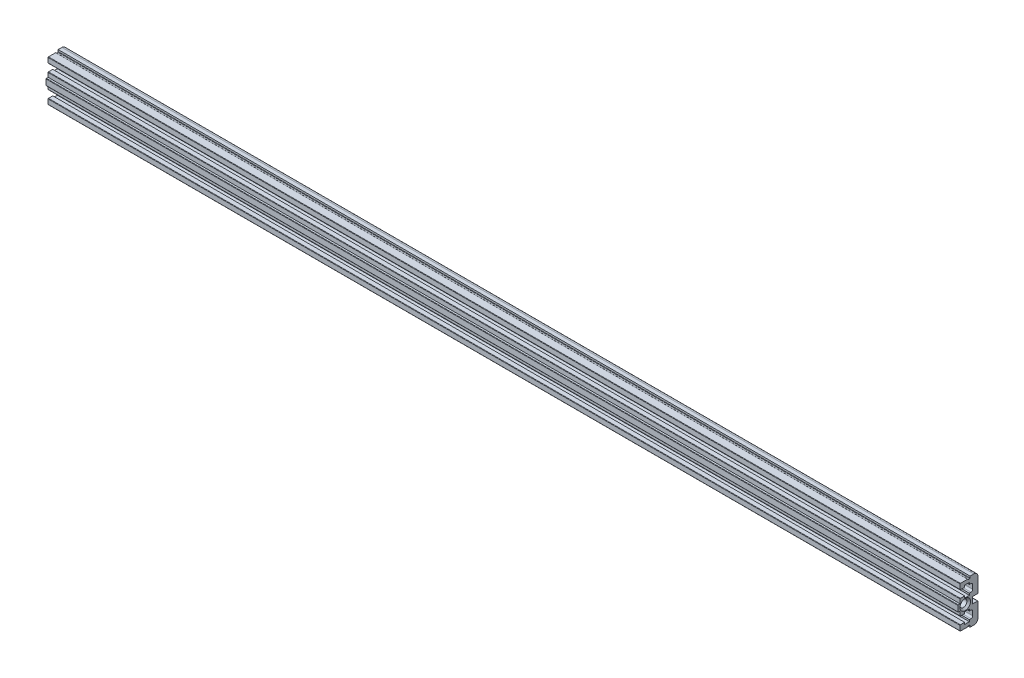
ISO-10303-21;
HEADER;
FILE_DESCRIPTION(('STEP AP214'),'2;1');
FILE_NAME('part.step','',(''),(''),'','','');
FILE_SCHEMA(('AUTOMOTIVE_DESIGN { 1 0 10303 214 1 1 1 1 }'));
ENDSEC;
DATA;
#1=APPLICATION_CONTEXT('core data for automotive mechanical design processes');
#2=APPLICATION_PROTOCOL_DEFINITION('international standard','automotive_design',2000,#1);
#3=PRODUCT_CONTEXT('',#1,'mechanical');
#4=PRODUCT('Part','Part','',(#3));
#5=PRODUCT_RELATED_PRODUCT_CATEGORY('part','',(#4));
#6=PRODUCT_DEFINITION_FORMATION('','',#4);
#7=PRODUCT_DEFINITION_CONTEXT('part definition',#1,'design');
#8=PRODUCT_DEFINITION('design','',#6,#7);
#9=PRODUCT_DEFINITION_SHAPE('','',#8);
#10=(LENGTH_UNIT() NAMED_UNIT(*) SI_UNIT(.MILLI.,.METRE.));
#11=(NAMED_UNIT(*) PLANE_ANGLE_UNIT() SI_UNIT($,.RADIAN.));
#12=(NAMED_UNIT(*) SI_UNIT($,.STERADIAN.) SOLID_ANGLE_UNIT());
#13=UNCERTAINTY_MEASURE_WITH_UNIT(LENGTH_MEASURE(1.E-05),#10,'distance_accuracy_value','');
#14=(GEOMETRIC_REPRESENTATION_CONTEXT(3) GLOBAL_UNCERTAINTY_ASSIGNED_CONTEXT((#13)) GLOBAL_UNIT_ASSIGNED_CONTEXT((#10,
#11,#12)) REPRESENTATION_CONTEXT('',''));
#15=CARTESIAN_POINT('',(0.,0.,0.));
#16=DIRECTION('',(0.,0.,1.));
#17=DIRECTION('',(1.,0.,0.));
#18=AXIS2_PLACEMENT_3D('',#15,#16,#17);
#19=CARTESIAN_POINT('',(-215.9,-19.4,12.5));
#20=DIRECTION('',(0.,1.,0.));
#21=DIRECTION('',(0.,0.,1.));
#22=AXIS2_PLACEMENT_3D('',#19,#20,#21);
#23=PLANE('',#22);
#24=DIRECTION('',(1.,0.,0.));
#25=VECTOR('',#24,1.);
#26=CARTESIAN_POINT('',(-215.9,-19.4,13.3));
#27=LINE('',#26,#25);
#28=CARTESIAN_POINT('',(215.9,-19.4,13.3));
#29=VERTEX_POINT('',#28);
#30=CARTESIAN_POINT('',(-215.9,-19.4,13.3));
#31=VERTEX_POINT('',#30);
#32=EDGE_CURVE('E325',#29,#31,#27,.F.);
#33=ORIENTED_EDGE('',*,*,#32,.T.);
#34=DIRECTION('',(0.,0.,1.));
#35=VECTOR('',#34,1.);
#36=CARTESIAN_POINT('',(-215.9,-19.4,12.5));
#37=LINE('',#36,#35);
#38=CARTESIAN_POINT('',(-215.9,-19.4,12.7));
#39=VERTEX_POINT('',#38);
#40=EDGE_CURVE('E310',#39,#31,#37,.T.);
#41=ORIENTED_EDGE('',*,*,#40,.F.);
#42=DIRECTION('',(1.,0.,0.));
#43=VECTOR('',#42,1.);
#44=CARTESIAN_POINT('',(-215.9,-19.4,12.7));
#45=LINE('',#44,#43);
#46=CARTESIAN_POINT('',(215.9,-19.4,12.7));
#47=VERTEX_POINT('',#46);
#48=EDGE_CURVE('E471',#39,#47,#45,.T.);
#49=ORIENTED_EDGE('',*,*,#48,.T.);
#50=DIRECTION('',(0.,0.,1.));
#51=VECTOR('',#50,1.);
#52=CARTESIAN_POINT('',(215.9,-19.4,12.5));
#53=LINE('',#52,#51);
#54=EDGE_CURVE('E320',#29,#47,#53,.F.);
#55=ORIENTED_EDGE('',*,*,#54,.F.);
#56=EDGE_LOOP('',(#33,#41,#49,#55));
#57=FACE_BOUND('',#56,.T.);
#58=ADVANCED_FACE('F15',(#57),#23,.F.);
#59=CARTESIAN_POINT('',(-215.9,-0.400000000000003,12.5));
#60=DIRECTION('',(0.,-1.,0.));
#61=DIRECTION('',(0.,0.,-1.));
#62=AXIS2_PLACEMENT_3D('',#59,#60,#61);
#63=PLANE('',#62);
#64=DIRECTION('',(1.,0.,0.));
#65=VECTOR('',#64,1.);
#66=CARTESIAN_POINT('',(-215.9,-0.400000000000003,12.7));
#67=LINE('',#66,#65);
#68=CARTESIAN_POINT('',(215.9,-0.400000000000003,12.7));
#69=VERTEX_POINT('',#68);
#70=CARTESIAN_POINT('',(-215.9,-0.400000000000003,12.7));
#71=VERTEX_POINT('',#70);
#72=EDGE_CURVE('E465',#69,#71,#67,.F.);
#73=ORIENTED_EDGE('',*,*,#72,.T.);
#74=DIRECTION('',(0.,0.,-1.));
#75=VECTOR('',#74,1.);
#76=CARTESIAN_POINT('',(-215.9,-0.400000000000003,12.5));
#77=LINE('',#76,#75);
#78=CARTESIAN_POINT('',(-215.9,-0.400000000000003,13.3));
#79=VERTEX_POINT('',#78);
#80=EDGE_CURVE('E478',#79,#71,#77,.T.);
#81=ORIENTED_EDGE('',*,*,#80,.F.);
#82=DIRECTION('',(1.,0.,0.));
#83=VECTOR('',#82,1.);
#84=CARTESIAN_POINT('',(-215.9,-0.400000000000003,13.3));
#85=LINE('',#84,#83);
#86=CARTESIAN_POINT('',(215.9,-0.400000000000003,13.3));
#87=VERTEX_POINT('',#86);
#88=EDGE_CURVE('E462',#79,#87,#85,.T.);
#89=ORIENTED_EDGE('',*,*,#88,.T.);
#90=DIRECTION('',(0.,0.,-1.));
#91=VECTOR('',#90,1.);
#92=CARTESIAN_POINT('',(215.9,-0.400000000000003,12.5));
#93=LINE('',#92,#91);
#94=EDGE_CURVE('E333',#69,#87,#93,.F.);
#95=ORIENTED_EDGE('',*,*,#94,.F.);
#96=EDGE_LOOP('',(#73,#81,#89,#95));
#97=FACE_BOUND('',#96,.T.);
#98=ADVANCED_FACE('F1799',(#97),#63,.F.);
#99=CARTESIAN_POINT('',(215.9,-9.9,14.8));
#100=DIRECTION('',(1.,0.,0.));
#101=DIRECTION('',(0.,0.,-1.));
#102=AXIS2_PLACEMENT_3D('',#99,#100,#101);
#103=CYLINDRICAL_SURFACE('',#102,1.25);
#104=CARTESIAN_POINT('',(-200.659655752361,-9.9,14.8));
#105=DIRECTION('',(-1.,0.,0.));
#106=DIRECTION('',(0.,0.,1.));
#107=AXIS2_PLACEMENT_3D('',#104,#105,#106);
#108=CIRCLE('',#107,1.250000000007);
#109=CARTESIAN_POINT('',(-200.659655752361,-9.9,16.050000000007));
#110=VERTEX_POINT('',#109);
#111=EDGE_CURVE('E330',#110,#110,#108,.T.);
#112=ORIENTED_EDGE('',*,*,#111,.T.);
#113=EDGE_LOOP('',(#112));
#114=FACE_BOUND('',#113,.T.);
#115=CARTESIAN_POINT('',(200.659655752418,-9.9,14.8));
#116=DIRECTION('',(1.,0.,0.));
#117=DIRECTION('',(0.,0.,-1.));
#118=AXIS2_PLACEMENT_3D('',#115,#116,#117);
#119=CIRCLE('',#118,1.25000000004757);
#120=CARTESIAN_POINT('',(200.659655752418,-9.9,13.5499999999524));
#121=VERTEX_POINT('',#120);
#122=EDGE_CURVE('E542',#121,#121,#119,.T.);
#123=ORIENTED_EDGE('',*,*,#122,.T.);
#124=EDGE_LOOP('',(#123));
#125=FACE_BOUND('',#124,.T.);
#126=ADVANCED_FACE('F1790',(#114,#125),#103,.F.);
#127=CARTESIAN_POINT('',(-200.899999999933,-9.9,14.8));
#128=DIRECTION('',(-1.,0.,0.));
#129=DIRECTION('',(0.,0.,1.));
#130=AXIS2_PLACEMENT_3D('',#127,#128,#129);
#131=CONICAL_SURFACE('',#130,1.65000000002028,1.02974425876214);
#132=ORIENTED_EDGE('',*,*,#111,.F.);
#133=EDGE_LOOP('',(#132));
#134=FACE_BOUND('',#133,.T.);
#135=CARTESIAN_POINT('',(-200.9,-9.9,14.8));
#136=DIRECTION('',(1.,0.,0.));
#137=DIRECTION('',(0.,0.,-1.));
#138=AXIS2_PLACEMENT_3D('',#135,#136,#137);
#139=CIRCLE('',#138,1.65);
#140=CARTESIAN_POINT('',(-200.9,-9.9,13.15));
#141=VERTEX_POINT('',#140);
#142=EDGE_CURVE('E454',#141,#141,#139,.F.);
#143=ORIENTED_EDGE('',*,*,#142,.T.);
#144=EDGE_LOOP('',(#143));
#145=FACE_BOUND('',#144,.T.);
#146=ADVANCED_FACE('F1782',(#134,#145),#131,.F.);
#147=CARTESIAN_POINT('',(-215.9,-19.6,13.3));
#148=DIRECTION('',(1.,0.,0.));
#149=DIRECTION('',(0.,0.,-1.));
#150=AXIS2_PLACEMENT_3D('',#147,#148,#149);
#151=CYLINDRICAL_SURFACE('',#150,0.2);
#152=DIRECTION('',(1.,0.,0.));
#153=VECTOR('',#152,1.);
#154=CARTESIAN_POINT('',(-215.9,-19.55,13.4936491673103));
#155=LINE('',#154,#153);
#156=CARTESIAN_POINT('',(-215.9,-19.55,13.4936491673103));
#157=VERTEX_POINT('',#156);
#158=CARTESIAN_POINT('',(215.9,-19.55,13.4936491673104));
#159=VERTEX_POINT('',#158);
#160=EDGE_CURVE('E328',#157,#159,#155,.T.);
#161=ORIENTED_EDGE('',*,*,#160,.F.);
#162=CARTESIAN_POINT('',(-215.9,-19.6,13.3));
#163=DIRECTION('',(1.,0.,0.));
#164=DIRECTION('',(0.,0.,-1.));
#165=AXIS2_PLACEMENT_3D('',#162,#163,#164);
#166=CIRCLE('',#165,0.2);
#167=EDGE_CURVE('E18',#31,#157,#166,.T.);
#168=ORIENTED_EDGE('',*,*,#167,.F.);
#169=ORIENTED_EDGE('',*,*,#32,.F.);
#170=CARTESIAN_POINT('',(215.9,-19.6,13.3));
#171=DIRECTION('',(1.,0.,0.));
#172=DIRECTION('',(0.,0.,-1.));
#173=AXIS2_PLACEMENT_3D('',#170,#171,#172);
#174=CIRCLE('',#173,0.2);
#175=EDGE_CURVE('E329',#159,#29,#174,.F.);
#176=ORIENTED_EDGE('',*,*,#175,.F.);
#177=EDGE_LOOP('',(#161,#168,#169,#176));
#178=FACE_BOUND('',#177,.T.);
#179=ADVANCED_FACE('F324',(#178),#151,.F.);
#180=CARTESIAN_POINT('',(-215.9,-19.6,12.7));
#181=DIRECTION('',(1.,0.,0.));
#182=DIRECTION('',(0.,0.,-1.));
#183=AXIS2_PLACEMENT_3D('',#180,#181,#182);
#184=CYLINDRICAL_SURFACE('',#183,0.2);
#185=DIRECTION('',(-1.,0.,0.));
#186=VECTOR('',#185,1.);
#187=CARTESIAN_POINT('',(-215.9,-19.6,12.5));
#188=LINE('',#187,#186);
#189=CARTESIAN_POINT('',(-215.9,-19.6,12.5));
#190=VERTEX_POINT('',#189);
#191=CARTESIAN_POINT('',(215.9,-19.6,12.5));
#192=VERTEX_POINT('',#191);
#193=EDGE_CURVE('E549',#190,#192,#188,.F.);
#194=ORIENTED_EDGE('',*,*,#193,.T.);
#195=CARTESIAN_POINT('',(215.9,-19.6,12.7));
#196=DIRECTION('',(1.,0.,0.));
#197=DIRECTION('',(0.,0.,-1.));
#198=AXIS2_PLACEMENT_3D('',#195,#196,#197);
#199=CIRCLE('',#198,0.2);
#200=EDGE_CURVE('E470',#47,#192,#199,.F.);
#201=ORIENTED_EDGE('',*,*,#200,.F.);
#202=ORIENTED_EDGE('',*,*,#48,.F.);
#203=CARTESIAN_POINT('',(-215.9,-19.6,12.7));
#204=DIRECTION('',(1.,0.,0.));
#205=DIRECTION('',(0.,0.,-1.));
#206=AXIS2_PLACEMENT_3D('',#203,#204,#205);
#207=CIRCLE('',#206,0.2);
#208=EDGE_CURVE('E315',#190,#39,#207,.T.);
#209=ORIENTED_EDGE('',*,*,#208,.F.);
#210=EDGE_LOOP('',(#194,#201,#202,#209));
#211=FACE_BOUND('',#210,.T.);
#212=ADVANCED_FACE('F1160',(#211),#184,.F.);
#213=CARTESIAN_POINT('',(-215.9,-0.200000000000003,12.7));
#214=DIRECTION('',(1.,0.,0.));
#215=DIRECTION('',(0.,0.,-1.));
#216=AXIS2_PLACEMENT_3D('',#213,#214,#215);
#217=CYLINDRICAL_SURFACE('',#216,0.2);
#218=ORIENTED_EDGE('',*,*,#72,.F.);
#219=CARTESIAN_POINT('',(215.9,-0.200000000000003,12.7));
#220=DIRECTION('',(1.,0.,0.));
#221=DIRECTION('',(0.,0.,-1.));
#222=AXIS2_PLACEMENT_3D('',#219,#220,#221);
#223=CIRCLE('',#222,0.2);
#224=CARTESIAN_POINT('',(215.9,-0.200000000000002,12.5));
#225=VERTEX_POINT('',#224);
#226=EDGE_CURVE('E466',#225,#69,#223,.F.);
#227=ORIENTED_EDGE('',*,*,#226,.F.);
#228=DIRECTION('',(1.,0.,0.));
#229=VECTOR('',#228,1.);
#230=CARTESIAN_POINT('',(-215.9,-0.200000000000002,12.5));
#231=LINE('',#230,#229);
#232=CARTESIAN_POINT('',(-215.9,-0.200000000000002,12.5));
#233=VERTEX_POINT('',#232);
#234=EDGE_CURVE('E552',#225,#233,#231,.F.);
#235=ORIENTED_EDGE('',*,*,#234,.T.);
#236=CARTESIAN_POINT('',(-215.9,-0.200000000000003,12.7));
#237=DIRECTION('',(1.,0.,0.));
#238=DIRECTION('',(0.,0.,-1.));
#239=AXIS2_PLACEMENT_3D('',#236,#237,#238);
#240=CIRCLE('',#239,0.2);
#241=EDGE_CURVE('E463',#71,#233,#240,.T.);
#242=ORIENTED_EDGE('',*,*,#241,.F.);
#243=EDGE_LOOP('',(#218,#227,#235,#242));
#244=FACE_BOUND('',#243,.T.);
#245=ADVANCED_FACE('F1758',(#244),#217,.F.);
#246=CARTESIAN_POINT('',(-215.9,-0.200000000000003,13.3));
#247=DIRECTION('',(1.,0.,0.));
#248=DIRECTION('',(0.,0.,-1.));
#249=AXIS2_PLACEMENT_3D('',#246,#247,#248);
#250=CYLINDRICAL_SURFACE('',#249,0.2);
#251=DIRECTION('',(1.,0.,0.));
#252=VECTOR('',#251,1.);
#253=CARTESIAN_POINT('',(-215.9,-0.249999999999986,13.4936491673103));
#254=LINE('',#253,#252);
#255=CARTESIAN_POINT('',(215.9,-0.249999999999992,13.4936491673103));
#256=VERTEX_POINT('',#255);
#257=CARTESIAN_POINT('',(-215.9,-0.249999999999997,13.4936491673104));
#258=VERTEX_POINT('',#257);
#259=EDGE_CURVE('E436',#256,#258,#254,.F.);
#260=ORIENTED_EDGE('',*,*,#259,.F.);
#261=CARTESIAN_POINT('',(215.9,-0.200000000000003,13.3));
#262=DIRECTION('',(1.,0.,0.));
#263=DIRECTION('',(0.,0.,-1.));
#264=AXIS2_PLACEMENT_3D('',#261,#262,#263);
#265=CIRCLE('',#264,0.2);
#266=EDGE_CURVE('E459',#87,#256,#265,.F.);
#267=ORIENTED_EDGE('',*,*,#266,.F.);
#268=ORIENTED_EDGE('',*,*,#88,.F.);
#269=CARTESIAN_POINT('',(-215.9,-0.200000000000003,13.3));
#270=DIRECTION('',(1.,0.,0.));
#271=DIRECTION('',(0.,0.,-1.));
#272=AXIS2_PLACEMENT_3D('',#269,#270,#271);
#273=CIRCLE('',#272,0.2);
#274=EDGE_CURVE('E455',#258,#79,#273,.T.);
#275=ORIENTED_EDGE('',*,*,#274,.F.);
#276=EDGE_LOOP('',(#260,#267,#268,#275));
#277=FACE_BOUND('',#276,.T.);
#278=ADVANCED_FACE('F1749',(#277),#250,.F.);
#279=CARTESIAN_POINT('',(-215.9,-2.7,12.85));
#280=DIRECTION('',(0.,1.,0.));
#281=DIRECTION('',(0.,0.,1.));
#282=AXIS2_PLACEMENT_3D('',#279,#280,#281);
#283=PLANE('',#282);
#284=DIRECTION('',(1.,0.,0.));
#285=VECTOR('',#284,1.);
#286=CARTESIAN_POINT('',(-215.9,-2.7,12.05));
#287=LINE('',#286,#285);
#288=CARTESIAN_POINT('',(-215.9,-2.7,12.05));
#289=VERTEX_POINT('',#288);
#290=CARTESIAN_POINT('',(215.9,-2.7,12.05));
#291=VERTEX_POINT('',#290);
#292=EDGE_CURVE('E426',#289,#291,#287,.T.);
#293=ORIENTED_EDGE('',*,*,#292,.T.);
#294=DIRECTION('',(0.,0.,1.));
#295=VECTOR('',#294,1.);
#296=CARTESIAN_POINT('',(215.9,-2.7,12.85));
#297=LINE('',#296,#295);
#298=CARTESIAN_POINT('',(215.9,-2.7,12.85));
#299=VERTEX_POINT('',#298);
#300=EDGE_CURVE('E458',#299,#291,#297,.F.);
#301=ORIENTED_EDGE('',*,*,#300,.F.);
#302=DIRECTION('',(1.,0.,0.));
#303=VECTOR('',#302,1.);
#304=CARTESIAN_POINT('',(-215.9,-2.7,12.85));
#305=LINE('',#304,#303);
#306=CARTESIAN_POINT('',(-215.9,-2.7,12.85));
#307=VERTEX_POINT('',#306);
#308=EDGE_CURVE('E429',#299,#307,#305,.F.);
#309=ORIENTED_EDGE('',*,*,#308,.T.);
#310=DIRECTION('',(0.,0.,1.));
#311=VECTOR('',#310,1.);
#312=CARTESIAN_POINT('',(-215.9,-2.7,12.85));
#313=LINE('',#312,#311);
#314=EDGE_CURVE('E581',#289,#307,#313,.T.);
#315=ORIENTED_EDGE('',*,*,#314,.F.);
#316=EDGE_LOOP('',(#293,#301,#309,#315));
#317=FACE_BOUND('',#316,.T.);
#318=ADVANCED_FACE('F1740',(#317),#283,.F.);
#319=CARTESIAN_POINT('',(-215.9,-6.25,12.85));
#320=DIRECTION('',(0.,-1.,0.));
#321=DIRECTION('',(0.,0.,-1.));
#322=AXIS2_PLACEMENT_3D('',#319,#320,#321);
#323=PLANE('',#322);
#324=DIRECTION('',(1.,0.,0.));
#325=VECTOR('',#324,1.);
#326=CARTESIAN_POINT('',(-215.9,-6.25,12.05));
#327=LINE('',#326,#325);
#328=CARTESIAN_POINT('',(215.9,-6.25,12.05));
#329=VERTEX_POINT('',#328);
#330=CARTESIAN_POINT('',(-215.9,-6.25,12.05));
#331=VERTEX_POINT('',#330);
#332=EDGE_CURVE('E417',#329,#331,#327,.F.);
#333=ORIENTED_EDGE('',*,*,#332,.T.);
#334=DIRECTION('',(0.,0.,-1.));
#335=VECTOR('',#334,1.);
#336=CARTESIAN_POINT('',(-215.9,-6.25,12.85));
#337=LINE('',#336,#335);
#338=CARTESIAN_POINT('',(-215.9,-6.25,12.85));
#339=VERTEX_POINT('',#338);
#340=EDGE_CURVE('E586',#339,#331,#337,.T.);
#341=ORIENTED_EDGE('',*,*,#340,.F.);
#342=DIRECTION('',(1.,0.,0.));
#343=VECTOR('',#342,1.);
#344=CARTESIAN_POINT('',(-215.9,-6.25,12.85));
#345=LINE('',#344,#343);
#346=CARTESIAN_POINT('',(215.9,-6.25,12.85));
#347=VERTEX_POINT('',#346);
#348=EDGE_CURVE('E501',#339,#347,#345,.T.);
#349=ORIENTED_EDGE('',*,*,#348,.T.);
#350=DIRECTION('',(0.,0.,-1.));
#351=VECTOR('',#350,1.);
#352=CARTESIAN_POINT('',(215.9,-6.25,12.85));
#353=LINE('',#352,#351);
#354=EDGE_CURVE('E592',#329,#347,#353,.F.);
#355=ORIENTED_EDGE('',*,*,#354,.F.);
#356=EDGE_LOOP('',(#333,#341,#349,#355));
#357=FACE_BOUND('',#356,.T.);
#358=ADVANCED_FACE('F1731',(#357),#323,.F.);
#359=CARTESIAN_POINT('',(-215.9,-13.55,12.85));
#360=DIRECTION('',(0.,1.,0.));
#361=DIRECTION('',(0.,0.,1.));
#362=AXIS2_PLACEMENT_3D('',#359,#360,#361);
#363=PLANE('',#362);
#364=DIRECTION('',(1.,0.,0.));
#365=VECTOR('',#364,1.);
#366=CARTESIAN_POINT('',(-215.9,-13.55,12.05));
#367=LINE('',#366,#365);
#368=CARTESIAN_POINT('',(-215.9,-13.55,12.05));
#369=VERTEX_POINT('',#368);
#370=CARTESIAN_POINT('',(215.9,-13.55,12.05));
#371=VERTEX_POINT('',#370);
#372=EDGE_CURVE('E392',#369,#371,#367,.T.);
#373=ORIENTED_EDGE('',*,*,#372,.T.);
#374=DIRECTION('',(0.,0.,1.));
#375=VECTOR('',#374,1.);
#376=CARTESIAN_POINT('',(215.9,-13.55,12.85));
#377=LINE('',#376,#375);
#378=CARTESIAN_POINT('',(215.9,-13.55,12.85));
#379=VERTEX_POINT('',#378);
#380=EDGE_CURVE('E595',#379,#371,#377,.F.);
#381=ORIENTED_EDGE('',*,*,#380,.F.);
#382=DIRECTION('',(1.,0.,0.));
#383=VECTOR('',#382,1.);
#384=CARTESIAN_POINT('',(-215.9,-13.55,12.85));
#385=LINE('',#384,#383);
#386=CARTESIAN_POINT('',(-215.9,-13.55,12.85));
#387=VERTEX_POINT('',#386);
#388=EDGE_CURVE('E395',#379,#387,#385,.F.);
#389=ORIENTED_EDGE('',*,*,#388,.T.);
#390=DIRECTION('',(0.,0.,1.));
#391=VECTOR('',#390,1.);
#392=CARTESIAN_POINT('',(-215.9,-13.55,12.85));
#393=LINE('',#392,#391);
#394=EDGE_CURVE('E649',#369,#387,#393,.T.);
#395=ORIENTED_EDGE('',*,*,#394,.F.);
#396=EDGE_LOOP('',(#373,#381,#389,#395));
#397=FACE_BOUND('',#396,.T.);
#398=ADVANCED_FACE('F1722',(#397),#363,.F.);
#399=CARTESIAN_POINT('',(-215.9,-17.1,12.85));
#400=DIRECTION('',(0.,-1.,0.));
#401=DIRECTION('',(0.,0.,-1.));
#402=AXIS2_PLACEMENT_3D('',#399,#400,#401);
#403=PLANE('',#402);
#404=DIRECTION('',(1.,0.,0.));
#405=VECTOR('',#404,1.);
#406=CARTESIAN_POINT('',(-215.9,-17.1,12.05));
#407=LINE('',#406,#405);
#408=CARTESIAN_POINT('',(215.9,-17.1,12.05));
#409=VERTEX_POINT('',#408);
#410=CARTESIAN_POINT('',(-215.9,-17.1,12.05));
#411=VERTEX_POINT('',#410);
#412=EDGE_CURVE('E383',#409,#411,#407,.F.);
#413=ORIENTED_EDGE('',*,*,#412,.T.);
#414=DIRECTION('',(0.,0.,-1.));
#415=VECTOR('',#414,1.);
#416=CARTESIAN_POINT('',(-215.9,-17.1,12.85));
#417=LINE('',#416,#415);
#418=CARTESIAN_POINT('',(-215.9,-17.1,12.85));
#419=VERTEX_POINT('',#418);
#420=EDGE_CURVE('E654',#419,#411,#417,.T.);
#421=ORIENTED_EDGE('',*,*,#420,.F.);
#422=DIRECTION('',(1.,0.,0.));
#423=VECTOR('',#422,1.);
#424=CARTESIAN_POINT('',(-215.9,-17.1,12.85));
#425=LINE('',#424,#423);
#426=CARTESIAN_POINT('',(215.9,-17.1,12.85));
#427=VERTEX_POINT('',#426);
#428=EDGE_CURVE('E531',#419,#427,#425,.T.);
#429=ORIENTED_EDGE('',*,*,#428,.T.);
#430=DIRECTION('',(0.,0.,-1.));
#431=VECTOR('',#430,1.);
#432=CARTESIAN_POINT('',(215.9,-17.1,12.85));
#433=LINE('',#432,#431);
#434=EDGE_CURVE('E545',#409,#427,#433,.F.);
#435=ORIENTED_EDGE('',*,*,#434,.F.);
#436=EDGE_LOOP('',(#413,#421,#429,#435));
#437=FACE_BOUND('',#436,.T.);
#438=ADVANCED_FACE('F1713',(#437),#403,.F.);
#439=CARTESIAN_POINT('',(200.89999999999,-9.9,14.8));
#440=DIRECTION('',(1.,0.,0.));
#441=DIRECTION('',(0.,0.,-1.));
#442=AXIS2_PLACEMENT_3D('',#439,#440,#441);
#443=CONICAL_SURFACE('',#442,1.64999999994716,1.02974425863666);
#444=CARTESIAN_POINT('',(200.9,-9.9,14.8));
#445=DIRECTION('',(-1.,0.,0.));
#446=DIRECTION('',(0.,0.,1.));
#447=AXIS2_PLACEMENT_3D('',#444,#445,#446);
#448=CIRCLE('',#447,1.65);
#449=CARTESIAN_POINT('',(200.9,-9.9,16.45));
#450=VERTEX_POINT('',#449);
#451=EDGE_CURVE('E372',#450,#450,#448,.F.);
#452=ORIENTED_EDGE('',*,*,#451,.T.);
#453=EDGE_LOOP('',(#452));
#454=FACE_BOUND('',#453,.T.);
#455=ORIENTED_EDGE('',*,*,#122,.F.);
#456=EDGE_LOOP('',(#455));
#457=FACE_BOUND('',#456,.T.);
#458=ADVANCED_FACE('F1704',(#454,#457),#443,.F.);
#459=CARTESIAN_POINT('',(-215.9,-9.9,14.8));
#460=DIRECTION('',(1.,0.,0.));
#461=DIRECTION('',(0.,0.,-1.));
#462=AXIS2_PLACEMENT_3D('',#459,#460,#461);
#463=CYLINDRICAL_SURFACE('',#462,1.65);
#464=ORIENTED_EDGE('',*,*,#142,.F.);
#465=EDGE_LOOP('',(#464));
#466=FACE_BOUND('',#465,.T.);
#467=CARTESIAN_POINT('',(-215.050000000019,-9.9,14.8));
#468=DIRECTION('',(-1.,0.,0.));
#469=DIRECTION('',(0.,0.,1.));
#470=AXIS2_PLACEMENT_3D('',#467,#468,#469);
#471=CIRCLE('',#470,1.65000000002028);
#472=CARTESIAN_POINT('',(-215.050000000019,-9.9,16.4500000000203));
#473=VERTEX_POINT('',#472);
#474=EDGE_CURVE('E688',#473,#473,#471,.T.);
#475=ORIENTED_EDGE('',*,*,#474,.T.);
#476=EDGE_LOOP('',(#475));
#477=FACE_BOUND('',#476,.T.);
#478=ADVANCED_FACE('F1696',(#466,#477),#463,.F.);
#479=CARTESIAN_POINT('',(-215.9,-19.5,13.6872983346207));
#480=DIRECTION('',(1.,0.,0.));
#481=DIRECTION('',(0.,0.,-1.));
#482=AXIS2_PLACEMENT_3D('',#479,#480,#481);
#483=CYLINDRICAL_SURFACE('',#482,0.2);
#484=CARTESIAN_POINT('',(215.9,-19.5,13.6872983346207));
#485=DIRECTION('',(1.,0.,0.));
#486=DIRECTION('',(0.,0.,-1.));
#487=AXIS2_PLACEMENT_3D('',#484,#485,#486);
#488=CIRCLE('',#487,0.2);
#489=CARTESIAN_POINT('',(215.9,-19.7,13.6872983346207));
#490=VERTEX_POINT('',#489);
#491=EDGE_CURVE('E448',#159,#490,#488,.F.);
#492=ORIENTED_EDGE('',*,*,#491,.T.);
#493=DIRECTION('',(1.,0.,0.));
#494=VECTOR('',#493,1.);
#495=CARTESIAN_POINT('',(-215.9,-19.7,13.6872983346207));
#496=LINE('',#495,#494);
#497=CARTESIAN_POINT('',(-215.9,-19.7,13.6872983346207));
#498=VERTEX_POINT('',#497);
#499=EDGE_CURVE('E766',#490,#498,#496,.F.);
#500=ORIENTED_EDGE('',*,*,#499,.T.);
#501=CARTESIAN_POINT('',(-215.9,-19.5,13.6872983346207));
#502=DIRECTION('',(1.,0.,0.));
#503=DIRECTION('',(0.,0.,-1.));
#504=AXIS2_PLACEMENT_3D('',#501,#502,#503);
#505=CIRCLE('',#504,0.2);
#506=EDGE_CURVE('E451',#498,#157,#505,.T.);
#507=ORIENTED_EDGE('',*,*,#506,.T.);
#508=ORIENTED_EDGE('',*,*,#160,.T.);
#509=EDGE_LOOP('',(#492,#500,#507,#508));
#510=FACE_BOUND('',#509,.T.);
#511=ADVANCED_FACE('F1041',(#510),#483,.T.);
#512=CARTESIAN_POINT('',(-215.9,-19.7,12.5));
#513=DIRECTION('',(0.,0.,-1.));
#514=DIRECTION('',(-1.,0.,0.));
#515=AXIS2_PLACEMENT_3D('',#512,#513,#514);
#516=PLANE('',#515);
#517=ORIENTED_EDGE('',*,*,#193,.F.);
#518=DIRECTION('',(0.,1.,0.));
#519=VECTOR('',#518,1.);
#520=CARTESIAN_POINT('',(-215.9,-19.7,12.5));
#521=LINE('',#520,#519);
#522=CARTESIAN_POINT('',(-215.9,-20.4,12.5));
#523=VERTEX_POINT('',#522);
#524=EDGE_CURVE('E450',#523,#190,#521,.T.);
#525=ORIENTED_EDGE('',*,*,#524,.F.);
#526=DIRECTION('',(1.,0.,0.));
#527=VECTOR('',#526,1.);
#528=CARTESIAN_POINT('',(215.9,-20.4,12.5));
#529=LINE('',#528,#527);
#530=CARTESIAN_POINT('',(215.9,-20.4,12.5));
#531=VERTEX_POINT('',#530);
#532=EDGE_CURVE('E769',#523,#531,#529,.T.);
#533=ORIENTED_EDGE('',*,*,#532,.T.);
#534=DIRECTION('',(0.,1.,0.));
#535=VECTOR('',#534,1.);
#536=CARTESIAN_POINT('',(215.9,-19.7,12.5));
#537=LINE('',#536,#535);
#538=EDGE_CURVE('E447',#192,#531,#537,.F.);
#539=ORIENTED_EDGE('',*,*,#538,.F.);
#540=EDGE_LOOP('',(#517,#525,#533,#539));
#541=FACE_BOUND('',#540,.T.);
#542=ADVANCED_FACE('F1156',(#541),#516,.F.);
#543=CARTESIAN_POINT('',(215.9,-11.6,8.95));
#544=DIRECTION('',(1.,0.,0.));
#545=DIRECTION('',(0.,0.,-1.));
#546=AXIS2_PLACEMENT_3D('',#543,#544,#545);
#547=CYLINDRICAL_SURFACE('',#546,0.2);
#548=CARTESIAN_POINT('',(-215.9,-11.6,8.95));
#549=DIRECTION('',(1.,0.,0.));
#550=DIRECTION('',(0.,0.,-1.));
#551=AXIS2_PLACEMENT_3D('',#548,#549,#550);
#552=CIRCLE('',#551,0.2);
#553=CARTESIAN_POINT('',(-215.9,-11.6,8.75));
#554=VERTEX_POINT('',#553);
#555=CARTESIAN_POINT('',(-215.9,-11.4,8.95));
#556=VERTEX_POINT('',#555);
#557=EDGE_CURVE('E442',#554,#556,#552,.T.);
#558=ORIENTED_EDGE('',*,*,#557,.T.);
#559=DIRECTION('',(1.,0.,0.));
#560=VECTOR('',#559,1.);
#561=CARTESIAN_POINT('',(215.9,-11.4,8.95));
#562=LINE('',#561,#560);
#563=CARTESIAN_POINT('',(215.9,-11.4,8.95));
#564=VERTEX_POINT('',#563);
#565=EDGE_CURVE('E782',#556,#564,#562,.T.);
#566=ORIENTED_EDGE('',*,*,#565,.T.);
#567=CARTESIAN_POINT('',(215.9,-11.6,8.95));
#568=DIRECTION('',(1.,0.,0.));
#569=DIRECTION('',(0.,0.,-1.));
#570=AXIS2_PLACEMENT_3D('',#567,#568,#569);
#571=CIRCLE('',#570,0.2);
#572=CARTESIAN_POINT('',(215.9,-11.6,8.75));
#573=VERTEX_POINT('',#572);
#574=EDGE_CURVE('E445',#564,#573,#571,.F.);
#575=ORIENTED_EDGE('',*,*,#574,.T.);
#576=DIRECTION('',(1.,0.,0.));
#577=VECTOR('',#576,1.);
#578=CARTESIAN_POINT('',(215.9,-11.6,8.75));
#579=LINE('',#578,#577);
#580=EDGE_CURVE('E779',#573,#554,#579,.F.);
#581=ORIENTED_EDGE('',*,*,#580,.T.);
#582=EDGE_LOOP('',(#558,#566,#575,#581));
#583=FACE_BOUND('',#582,.T.);
#584=ADVANCED_FACE('F1139',(#583),#547,.T.);
#585=CARTESIAN_POINT('',(-215.9,-0.100000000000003,12.5));
#586=DIRECTION('',(0.,0.,-1.));
#587=DIRECTION('',(0.,1.,0.));
#588=AXIS2_PLACEMENT_3D('',#585,#586,#587);
#589=PLANE('',#588);
#590=ORIENTED_EDGE('',*,*,#234,.F.);
#591=DIRECTION('',(0.,1.,0.));
#592=VECTOR('',#591,1.);
#593=CARTESIAN_POINT('',(215.9,-0.100000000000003,12.5));
#594=LINE('',#593,#592);
#595=CARTESIAN_POINT('',(215.9,0.599999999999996,12.5));
#596=VERTEX_POINT('',#595);
#597=EDGE_CURVE('E444',#596,#225,#594,.F.);
#598=ORIENTED_EDGE('',*,*,#597,.F.);
#599=DIRECTION('',(1.,0.,0.));
#600=VECTOR('',#599,1.);
#601=CARTESIAN_POINT('',(215.9,0.599999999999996,12.5));
#602=LINE('',#601,#600);
#603=CARTESIAN_POINT('',(-215.9,0.599999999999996,12.5));
#604=VERTEX_POINT('',#603);
#605=EDGE_CURVE('E803',#596,#604,#602,.F.);
#606=ORIENTED_EDGE('',*,*,#605,.T.);
#607=DIRECTION('',(0.,1.,0.));
#608=VECTOR('',#607,1.);
#609=CARTESIAN_POINT('',(-215.9,-0.100000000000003,12.5));
#610=LINE('',#609,#608);
#611=EDGE_CURVE('E441',#233,#604,#610,.T.);
#612=ORIENTED_EDGE('',*,*,#611,.F.);
#613=EDGE_LOOP('',(#590,#598,#606,#612));
#614=FACE_BOUND('',#613,.T.);
#615=ADVANCED_FACE('F1665',(#614),#589,.F.);
#616=CARTESIAN_POINT('',(-215.9,-0.300000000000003,13.6872983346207));
#617=DIRECTION('',(1.,0.,0.));
#618=DIRECTION('',(0.,0.,-1.));
#619=AXIS2_PLACEMENT_3D('',#616,#617,#618);
#620=CYLINDRICAL_SURFACE('',#619,0.2);
#621=CARTESIAN_POINT('',(215.9,-0.300000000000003,13.6872983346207));
#622=DIRECTION('',(1.,0.,0.));
#623=DIRECTION('',(0.,0.,-1.));
#624=AXIS2_PLACEMENT_3D('',#621,#622,#623);
#625=CIRCLE('',#624,0.2);
#626=CARTESIAN_POINT('',(215.9,-0.100000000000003,13.6872983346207));
#627=VERTEX_POINT('',#626);
#628=EDGE_CURVE('E437',#627,#256,#625,.F.);
#629=ORIENTED_EDGE('',*,*,#628,.T.);
#630=ORIENTED_EDGE('',*,*,#259,.T.);
#631=CARTESIAN_POINT('',(-215.9,-0.300000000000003,13.6872983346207));
#632=DIRECTION('',(1.,0.,0.));
#633=DIRECTION('',(0.,0.,-1.));
#634=AXIS2_PLACEMENT_3D('',#631,#632,#633);
#635=CIRCLE('',#634,0.2);
#636=CARTESIAN_POINT('',(-215.9,-0.100000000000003,13.6872983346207));
#637=VERTEX_POINT('',#636);
#638=EDGE_CURVE('E439',#258,#637,#635,.T.);
#639=ORIENTED_EDGE('',*,*,#638,.T.);
#640=DIRECTION('',(1.,0.,0.));
#641=VECTOR('',#640,1.);
#642=CARTESIAN_POINT('',(-215.9,-0.100000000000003,13.6872983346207));
#643=LINE('',#642,#641);
#644=EDGE_CURVE('E811',#637,#627,#643,.T.);
#645=ORIENTED_EDGE('',*,*,#644,.T.);
#646=EDGE_LOOP('',(#629,#630,#639,#645));
#647=FACE_BOUND('',#646,.T.);
#648=ADVANCED_FACE('F1656',(#647),#620,.T.);
#649=CARTESIAN_POINT('',(-215.9,-0.300000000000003,17.05));
#650=DIRECTION('',(-1.,0.,0.));
#651=DIRECTION('',(0.,0.,1.));
#652=AXIS2_PLACEMENT_3D('',#649,#650,#651);
#653=CYLINDRICAL_SURFACE('',#652,0.199999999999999);
#654=CARTESIAN_POINT('',(215.9,-0.300000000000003,17.05));
#655=DIRECTION('',(-1.,0.,0.));
#656=DIRECTION('',(0.,0.,1.));
#657=AXIS2_PLACEMENT_3D('',#654,#655,#656);
#658=CIRCLE('',#657,0.199999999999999);
#659=CARTESIAN_POINT('',(215.9,-0.300000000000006,17.25));
#660=VERTEX_POINT('',#659);
#661=CARTESIAN_POINT('',(215.9,-0.100000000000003,17.05));
#662=VERTEX_POINT('',#661);
#663=EDGE_CURVE('E432',#660,#662,#658,.T.);
#664=ORIENTED_EDGE('',*,*,#663,.T.);
#665=DIRECTION('',(1.,0.,0.));
#666=VECTOR('',#665,1.);
#667=CARTESIAN_POINT('',(-215.9,-0.100000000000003,17.05));
#668=LINE('',#667,#666);
#669=CARTESIAN_POINT('',(-215.9,-0.100000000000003,17.05));
#670=VERTEX_POINT('',#669);
#671=EDGE_CURVE('E812',#662,#670,#668,.F.);
#672=ORIENTED_EDGE('',*,*,#671,.T.);
#673=CARTESIAN_POINT('',(-215.9,-0.300000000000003,17.05));
#674=DIRECTION('',(-1.,0.,0.));
#675=DIRECTION('',(0.,0.,1.));
#676=AXIS2_PLACEMENT_3D('',#673,#674,#675);
#677=CIRCLE('',#676,0.199999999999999);
#678=CARTESIAN_POINT('',(-215.9,-0.300000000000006,17.25));
#679=VERTEX_POINT('',#678);
#680=EDGE_CURVE('E434',#670,#679,#677,.F.);
#681=ORIENTED_EDGE('',*,*,#680,.T.);
#682=DIRECTION('',(1.,0.,0.));
#683=VECTOR('',#682,1.);
#684=CARTESIAN_POINT('',(215.9,-0.300000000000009,17.25));
#685=LINE('',#684,#683);
#686=EDGE_CURVE('E815',#679,#660,#685,.T.);
#687=ORIENTED_EDGE('',*,*,#686,.T.);
#688=EDGE_LOOP('',(#664,#672,#681,#687));
#689=FACE_BOUND('',#688,.T.);
#690=ADVANCED_FACE('F1647',(#689),#653,.T.);
#691=CARTESIAN_POINT('',(215.9,-2.5,17.05));
#692=DIRECTION('',(-1.,0.,0.));
#693=DIRECTION('',(0.,0.,1.));
#694=AXIS2_PLACEMENT_3D('',#691,#692,#693);
#695=CYLINDRICAL_SURFACE('',#694,0.199999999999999);
#696=CARTESIAN_POINT('',(215.9,-2.5,17.05));
#697=DIRECTION('',(-1.,0.,0.));
#698=DIRECTION('',(0.,0.,1.));
#699=AXIS2_PLACEMENT_3D('',#696,#697,#698);
#700=CIRCLE('',#699,0.199999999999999);
#701=CARTESIAN_POINT('',(215.9,-2.7,17.05));
#702=VERTEX_POINT('',#701);
#703=CARTESIAN_POINT('',(215.9,-2.5,17.25));
#704=VERTEX_POINT('',#703);
#705=EDGE_CURVE('E427',#702,#704,#700,.T.);
#706=ORIENTED_EDGE('',*,*,#705,.T.);
#707=DIRECTION('',(1.,0.,0.));
#708=VECTOR('',#707,1.);
#709=CARTESIAN_POINT('',(215.9,-2.50000000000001,17.25));
#710=LINE('',#709,#708);
#711=CARTESIAN_POINT('',(-215.9,-2.5,17.25));
#712=VERTEX_POINT('',#711);
#713=EDGE_CURVE('E818',#704,#712,#710,.F.);
#714=ORIENTED_EDGE('',*,*,#713,.T.);
#715=CARTESIAN_POINT('',(-215.9,-2.5,17.05));
#716=DIRECTION('',(-1.,0.,0.));
#717=DIRECTION('',(0.,0.,1.));
#718=AXIS2_PLACEMENT_3D('',#715,#716,#717);
#719=CIRCLE('',#718,0.199999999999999);
#720=CARTESIAN_POINT('',(-215.9,-2.7,17.05));
#721=VERTEX_POINT('',#720);
#722=EDGE_CURVE('E430',#712,#721,#719,.F.);
#723=ORIENTED_EDGE('',*,*,#722,.T.);
#724=DIRECTION('',(1.,0.,0.));
#725=VECTOR('',#724,1.);
#726=CARTESIAN_POINT('',(-215.9,-2.7,17.05));
#727=LINE('',#726,#725);
#728=EDGE_CURVE('E828',#721,#702,#727,.T.);
#729=ORIENTED_EDGE('',*,*,#728,.T.);
#730=EDGE_LOOP('',(#706,#714,#723,#729));
#731=FACE_BOUND('',#730,.T.);
#732=ADVANCED_FACE('F1638',(#731),#695,.T.);
#733=CARTESIAN_POINT('',(-215.9,-1.85,12.85));
#734=DIRECTION('',(0.,0.,-1.));
#735=DIRECTION('',(0.,1.,0.));
#736=AXIS2_PLACEMENT_3D('',#733,#734,#735);
#737=PLANE('',#736);
#738=DIRECTION('',(1.,0.,0.));
#739=VECTOR('',#738,1.);
#740=CARTESIAN_POINT('',(-215.9,-1.85,12.85));
#741=LINE('',#740,#739);
#742=CARTESIAN_POINT('',(215.9,-1.85,12.85));
#743=VERTEX_POINT('',#742);
#744=CARTESIAN_POINT('',(-215.9,-1.85,12.85));
#745=VERTEX_POINT('',#744);
#746=EDGE_CURVE('E577',#743,#745,#741,.F.);
#747=ORIENTED_EDGE('',*,*,#746,.T.);
#748=DIRECTION('',(0.,1.,0.));
#749=VECTOR('',#748,1.);
#750=CARTESIAN_POINT('',(-215.9,-1.85,12.85));
#751=LINE('',#750,#749);
#752=EDGE_CURVE('E488',#307,#745,#751,.T.);
#753=ORIENTED_EDGE('',*,*,#752,.F.);
#754=ORIENTED_EDGE('',*,*,#308,.F.);
#755=DIRECTION('',(0.,1.,0.));
#756=VECTOR('',#755,1.);
#757=CARTESIAN_POINT('',(215.9,-1.85,12.85));
#758=LINE('',#757,#756);
#759=EDGE_CURVE('E484',#743,#299,#758,.F.);
#760=ORIENTED_EDGE('',*,*,#759,.F.);
#761=EDGE_LOOP('',(#747,#753,#754,#760));
#762=FACE_BOUND('',#761,.T.);
#763=ADVANCED_FACE('F1629',(#762),#737,.F.);
#764=CARTESIAN_POINT('',(-215.9,-1.85,15.05));
#765=DIRECTION('',(0.,0.,1.));
#766=DIRECTION('',(0.,-1.,0.));
#767=AXIS2_PLACEMENT_3D('',#764,#765,#766);
#768=PLANE('',#767);
#769=DIRECTION('',(1.,0.,0.));
#770=VECTOR('',#769,1.);
#771=CARTESIAN_POINT('',(-215.9,-2.7,15.05));
#772=LINE('',#771,#770);
#773=CARTESIAN_POINT('',(215.9,-2.7,15.05));
#774=VERTEX_POINT('',#773);
#775=CARTESIAN_POINT('',(-215.9,-2.7,15.05));
#776=VERTEX_POINT('',#775);
#777=EDGE_CURVE('E821',#774,#776,#772,.F.);
#778=ORIENTED_EDGE('',*,*,#777,.T.);
#779=DIRECTION('',(0.,-1.,0.));
#780=VECTOR('',#779,1.);
#781=CARTESIAN_POINT('',(-215.9,-1.85,15.05));
#782=LINE('',#781,#780);
#783=CARTESIAN_POINT('',(-215.9,-1.85,15.05));
#784=VERTEX_POINT('',#783);
#785=EDGE_CURVE('E487',#784,#776,#782,.T.);
#786=ORIENTED_EDGE('',*,*,#785,.F.);
#787=DIRECTION('',(1.,0.,0.));
#788=VECTOR('',#787,1.);
#789=CARTESIAN_POINT('',(-215.9,-1.85,15.05));
#790=LINE('',#789,#788);
#791=CARTESIAN_POINT('',(215.9,-1.85,15.05));
#792=VERTEX_POINT('',#791);
#793=EDGE_CURVE('E573',#784,#792,#790,.T.);
#794=ORIENTED_EDGE('',*,*,#793,.T.);
#795=DIRECTION('',(0.,-1.,0.));
#796=VECTOR('',#795,1.);
#797=CARTESIAN_POINT('',(215.9,-1.85,15.05));
#798=LINE('',#797,#796);
#799=EDGE_CURVE('E589',#774,#792,#798,.F.);
#800=ORIENTED_EDGE('',*,*,#799,.F.);
#801=EDGE_LOOP('',(#778,#786,#794,#800));
#802=FACE_BOUND('',#801,.T.);
#803=ADVANCED_FACE('F1620',(#802),#768,.F.);
#804=CARTESIAN_POINT('',(-215.9,-3.5,12.05));
#805=DIRECTION('',(1.,0.,0.));
#806=DIRECTION('',(0.,0.,-1.));
#807=AXIS2_PLACEMENT_3D('',#804,#805,#806);
#808=CYLINDRICAL_SURFACE('',#807,0.8);
#809=DIRECTION('',(-1.,0.,0.));
#810=VECTOR('',#809,1.);
#811=CARTESIAN_POINT('',(-215.9,-3.5,11.25));
#812=LINE('',#811,#810);
#813=CARTESIAN_POINT('',(-215.9,-3.5,11.25));
#814=VERTEX_POINT('',#813);
#815=CARTESIAN_POINT('',(215.9,-3.5,11.25));
#816=VERTEX_POINT('',#815);
#817=EDGE_CURVE('E576',#814,#816,#812,.F.);
#818=ORIENTED_EDGE('',*,*,#817,.T.);
#819=CARTESIAN_POINT('',(215.9,-3.5,12.05));
#820=DIRECTION('',(1.,0.,0.));
#821=DIRECTION('',(0.,0.,-1.));
#822=AXIS2_PLACEMENT_3D('',#819,#820,#821);
#823=CIRCLE('',#822,0.8);
#824=EDGE_CURVE('E424',#291,#816,#823,.F.);
#825=ORIENTED_EDGE('',*,*,#824,.F.);
#826=ORIENTED_EDGE('',*,*,#292,.F.);
#827=CARTESIAN_POINT('',(-215.9,-3.5,12.05));
#828=DIRECTION('',(1.,0.,0.));
#829=DIRECTION('',(0.,0.,-1.));
#830=AXIS2_PLACEMENT_3D('',#827,#828,#829);
#831=CIRCLE('',#830,0.8);
#832=EDGE_CURVE('E421',#814,#289,#831,.T.);
#833=ORIENTED_EDGE('',*,*,#832,.F.);
#834=EDGE_LOOP('',(#818,#825,#826,#833));
#835=FACE_BOUND('',#834,.T.);
#836=ADVANCED_FACE('F1611',(#835),#808,.F.);
#837=CARTESIAN_POINT('',(-215.9,-5.45,12.05));
#838=DIRECTION('',(1.,0.,0.));
#839=DIRECTION('',(0.,0.,-1.));
#840=AXIS2_PLACEMENT_3D('',#837,#838,#839);
#841=CYLINDRICAL_SURFACE('',#840,0.8);
#842=ORIENTED_EDGE('',*,*,#332,.F.);
#843=CARTESIAN_POINT('',(215.9,-5.45,12.05));
#844=DIRECTION('',(1.,0.,0.));
#845=DIRECTION('',(0.,0.,-1.));
#846=AXIS2_PLACEMENT_3D('',#843,#844,#845);
#847=CIRCLE('',#846,0.8);
#848=CARTESIAN_POINT('',(215.9,-5.45,11.25));
#849=VERTEX_POINT('',#848);
#850=EDGE_CURVE('E418',#849,#329,#847,.F.);
#851=ORIENTED_EDGE('',*,*,#850,.F.);
#852=DIRECTION('',(-1.,0.,0.));
#853=VECTOR('',#852,1.);
#854=CARTESIAN_POINT('',(-215.9,-5.45,11.25));
#855=LINE('',#854,#853);
#856=CARTESIAN_POINT('',(-215.9,-5.45,11.25));
#857=VERTEX_POINT('',#856);
#858=EDGE_CURVE('E619',#849,#857,#855,.T.);
#859=ORIENTED_EDGE('',*,*,#858,.T.);
#860=CARTESIAN_POINT('',(-215.9,-5.45,12.05));
#861=DIRECTION('',(1.,0.,0.));
#862=DIRECTION('',(0.,0.,-1.));
#863=AXIS2_PLACEMENT_3D('',#860,#861,#862);
#864=CIRCLE('',#863,0.8);
#865=EDGE_CURVE('E414',#331,#857,#864,.T.);
#866=ORIENTED_EDGE('',*,*,#865,.F.);
#867=EDGE_LOOP('',(#842,#851,#859,#866));
#868=FACE_BOUND('',#867,.T.);
#869=ADVANCED_FACE('F1602',(#868),#841,.F.);
#870=CARTESIAN_POINT('',(-215.9,-6.25,12.85));
#871=DIRECTION('',(0.,0.,-1.));
#872=DIRECTION('',(0.,1.,0.));
#873=AXIS2_PLACEMENT_3D('',#870,#871,#872);
#874=PLANE('',#873);
#875=ORIENTED_EDGE('',*,*,#348,.F.);
#876=DIRECTION('',(0.,1.,0.));
#877=VECTOR('',#876,1.);
#878=CARTESIAN_POINT('',(-215.9,-6.25,12.85));
#879=LINE('',#878,#877);
#880=CARTESIAN_POINT('',(-215.9,-7.1,12.85));
#881=VERTEX_POINT('',#880);
#882=EDGE_CURVE('E416',#881,#339,#879,.T.);
#883=ORIENTED_EDGE('',*,*,#882,.F.);
#884=DIRECTION('',(1.,0.,0.));
#885=VECTOR('',#884,1.);
#886=CARTESIAN_POINT('',(-215.9,-7.1,12.85));
#887=LINE('',#886,#885);
#888=CARTESIAN_POINT('',(215.9,-7.1,12.85));
#889=VERTEX_POINT('',#888);
#890=EDGE_CURVE('E618',#881,#889,#887,.T.);
#891=ORIENTED_EDGE('',*,*,#890,.T.);
#892=DIRECTION('',(0.,1.,0.));
#893=VECTOR('',#892,1.);
#894=CARTESIAN_POINT('',(215.9,-6.25,12.85));
#895=LINE('',#894,#893);
#896=EDGE_CURVE('E506',#347,#889,#895,.F.);
#897=ORIENTED_EDGE('',*,*,#896,.F.);
#898=EDGE_LOOP('',(#875,#883,#891,#897));
#899=FACE_BOUND('',#898,.T.);
#900=ADVANCED_FACE('F1593',(#899),#874,.F.);
#901=CARTESIAN_POINT('',(-215.9,-6.25000000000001,15.05));
#902=DIRECTION('',(0.,0.,1.));
#903=DIRECTION('',(1.,0.,0.));
#904=AXIS2_PLACEMENT_3D('',#901,#902,#903);
#905=PLANE('',#904);
#906=DIRECTION('',(1.,0.,0.));
#907=VECTOR('',#906,1.);
#908=CARTESIAN_POINT('',(-215.9,-7.1,15.05));
#909=LINE('',#908,#907);
#910=CARTESIAN_POINT('',(215.9,-7.1,15.05));
#911=VERTEX_POINT('',#910);
#912=CARTESIAN_POINT('',(-215.9,-7.1,15.05));
#913=VERTEX_POINT('',#912);
#914=EDGE_CURVE('E615',#911,#913,#909,.F.);
#915=ORIENTED_EDGE('',*,*,#914,.T.);
#916=DIRECTION('',(0.,1.,0.));
#917=VECTOR('',#916,1.);
#918=CARTESIAN_POINT('',(-215.9,-6.25000000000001,15.05));
#919=LINE('',#918,#917);
#920=CARTESIAN_POINT('',(-215.9,-6.25000000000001,15.05));
#921=VERTEX_POINT('',#920);
#922=EDGE_CURVE('E511',#921,#913,#919,.F.);
#923=ORIENTED_EDGE('',*,*,#922,.F.);
#924=DIRECTION('',(1.,0.,0.));
#925=VECTOR('',#924,1.);
#926=CARTESIAN_POINT('',(-215.9,-6.25,15.05));
#927=LINE('',#926,#925);
#928=CARTESIAN_POINT('',(215.9,-6.25000000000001,15.05));
#929=VERTEX_POINT('',#928);
#930=EDGE_CURVE('E839',#921,#929,#927,.T.);
#931=ORIENTED_EDGE('',*,*,#930,.T.);
#932=DIRECTION('',(0.,1.,0.));
#933=VECTOR('',#932,1.);
#934=CARTESIAN_POINT('',(215.9,-6.25000000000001,15.05));
#935=LINE('',#934,#933);
#936=EDGE_CURVE('E717',#911,#929,#935,.T.);
#937=ORIENTED_EDGE('',*,*,#936,.F.);
#938=EDGE_LOOP('',(#915,#923,#931,#937));
#939=FACE_BOUND('',#938,.T.);
#940=ADVANCED_FACE('F1584',(#939),#905,.F.);
#941=CARTESIAN_POINT('',(215.9,-8.4,17.25));
#942=DIRECTION('',(0.,1.,0.));
#943=DIRECTION('',(0.,0.,1.));
#944=AXIS2_PLACEMENT_3D('',#941,#942,#943);
#945=PLANE('',#944);
#946=DIRECTION('',(0.,0.,1.));
#947=VECTOR('',#946,1.);
#948=CARTESIAN_POINT('',(215.9,-8.4,17.25));
#949=LINE('',#948,#947);
#950=CARTESIAN_POINT('',(215.9,-8.4,18.05));
#951=VERTEX_POINT('',#950);
#952=CARTESIAN_POINT('',(215.9,-8.40000000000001,17.25));
#953=VERTEX_POINT('',#952);
#954=EDGE_CURVE('E413',#951,#953,#949,.F.);
#955=ORIENTED_EDGE('',*,*,#954,.T.);
#956=DIRECTION('',(1.,0.,0.));
#957=VECTOR('',#956,1.);
#958=CARTESIAN_POINT('',(215.9,-8.40000000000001,17.25));
#959=LINE('',#958,#957);
#960=CARTESIAN_POINT('',(-215.9,-8.40000000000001,17.25));
#961=VERTEX_POINT('',#960);
#962=EDGE_CURVE('E847',#953,#961,#959,.F.);
#963=ORIENTED_EDGE('',*,*,#962,.T.);
#964=DIRECTION('',(0.,0.,1.));
#965=VECTOR('',#964,1.);
#966=CARTESIAN_POINT('',(-215.9,-8.4,17.25));
#967=LINE('',#966,#965);
#968=CARTESIAN_POINT('',(-215.9,-8.4,18.05));
#969=VERTEX_POINT('',#968);
#970=EDGE_CURVE('E720',#961,#969,#967,.T.);
#971=ORIENTED_EDGE('',*,*,#970,.T.);
#972=DIRECTION('',(1.,0.,0.));
#973=VECTOR('',#972,1.);
#974=CARTESIAN_POINT('',(215.9,-8.4,18.05));
#975=LINE('',#974,#973);
#976=EDGE_CURVE('E402',#951,#969,#975,.F.);
#977=ORIENTED_EDGE('',*,*,#976,.F.);
#978=EDGE_LOOP('',(#955,#963,#971,#977));
#979=FACE_BOUND('',#978,.T.);
#980=ADVANCED_FACE('F1575',(#979),#945,.T.);
#981=CARTESIAN_POINT('',(-215.9,-6.45,17.05));
#982=DIRECTION('',(-1.,0.,0.));
#983=DIRECTION('',(0.,0.,1.));
#984=AXIS2_PLACEMENT_3D('',#981,#982,#983);
#985=CYLINDRICAL_SURFACE('',#984,0.199999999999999);
#986=CARTESIAN_POINT('',(215.9,-6.45,17.05));
#987=DIRECTION('',(-1.,0.,0.));
#988=DIRECTION('',(0.,0.,1.));
#989=AXIS2_PLACEMENT_3D('',#986,#987,#988);
#990=CIRCLE('',#989,0.199999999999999);
#991=CARTESIAN_POINT('',(215.9,-6.45000000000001,17.25));
#992=VERTEX_POINT('',#991);
#993=CARTESIAN_POINT('',(215.9,-6.25000000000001,17.05));
#994=VERTEX_POINT('',#993);
#995=EDGE_CURVE('E409',#992,#994,#990,.T.);
#996=ORIENTED_EDGE('',*,*,#995,.T.);
#997=DIRECTION('',(1.,0.,0.));
#998=VECTOR('',#997,1.);
#999=CARTESIAN_POINT('',(-215.9,-6.25,17.05));
#1000=LINE('',#999,#998);
#1001=CARTESIAN_POINT('',(-215.9,-6.25000000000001,17.05));
#1002=VERTEX_POINT('',#1001);
#1003=EDGE_CURVE('E844',#994,#1002,#1000,.F.);
#1004=ORIENTED_EDGE('',*,*,#1003,.T.);
#1005=CARTESIAN_POINT('',(-215.9,-6.45,17.05));
#1006=DIRECTION('',(-1.,0.,0.));
#1007=DIRECTION('',(0.,0.,1.));
#1008=AXIS2_PLACEMENT_3D('',#1005,#1006,#1007);
#1009=CIRCLE('',#1008,0.199999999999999);
#1010=CARTESIAN_POINT('',(-215.9,-6.45000000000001,17.25));
#1011=VERTEX_POINT('',#1010);
#1012=EDGE_CURVE('E411',#1002,#1011,#1009,.F.);
#1013=ORIENTED_EDGE('',*,*,#1012,.T.);
#1014=DIRECTION('',(1.,0.,0.));
#1015=VECTOR('',#1014,1.);
#1016=CARTESIAN_POINT('',(215.9,-6.45000000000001,17.25));
#1017=LINE('',#1016,#1015);
#1018=EDGE_CURVE('E852',#1011,#992,#1017,.T.);
#1019=ORIENTED_EDGE('',*,*,#1018,.T.);
#1020=EDGE_LOOP('',(#996,#1004,#1013,#1019));
#1021=FACE_BOUND('',#1020,.T.);
#1022=ADVANCED_FACE('F1566',(#1021),#985,.T.);
#1023=CARTESIAN_POINT('',(215.9,-11.2,18.05));
#1024=DIRECTION('',(1.,0.,0.));
#1025=DIRECTION('',(0.,0.,-1.));
#1026=AXIS2_PLACEMENT_3D('',#1023,#1024,#1025);
#1027=CYLINDRICAL_SURFACE('',#1026,0.199999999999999);
#1028=CARTESIAN_POINT('',(-215.9,-11.2,18.05));
#1029=DIRECTION('',(1.,0.,0.));
#1030=DIRECTION('',(0.,0.,-1.));
#1031=AXIS2_PLACEMENT_3D('',#1028,#1029,#1030);
#1032=CIRCLE('',#1031,0.199999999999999);
#1033=CARTESIAN_POINT('',(-215.9,-11.2,18.25));
#1034=VERTEX_POINT('',#1033);
#1035=CARTESIAN_POINT('',(-215.9,-11.4,18.05));
#1036=VERTEX_POINT('',#1035);
#1037=EDGE_CURVE('E405',#1034,#1036,#1032,.T.);
#1038=ORIENTED_EDGE('',*,*,#1037,.T.);
#1039=DIRECTION('',(1.,0.,0.));
#1040=VECTOR('',#1039,1.);
#1041=CARTESIAN_POINT('',(215.9,-11.4,18.05));
#1042=LINE('',#1041,#1040);
#1043=CARTESIAN_POINT('',(215.9,-11.4,18.05));
#1044=VERTEX_POINT('',#1043);
#1045=EDGE_CURVE('E622',#1044,#1036,#1042,.F.);
#1046=ORIENTED_EDGE('',*,*,#1045,.F.);
#1047=CARTESIAN_POINT('',(215.9,-11.2,18.05));
#1048=DIRECTION('',(1.,0.,0.));
#1049=DIRECTION('',(0.,0.,-1.));
#1050=AXIS2_PLACEMENT_3D('',#1047,#1048,#1049);
#1051=CIRCLE('',#1050,0.199999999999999);
#1052=CARTESIAN_POINT('',(215.9,-11.2,18.25));
#1053=VERTEX_POINT('',#1052);
#1054=EDGE_CURVE('E407',#1044,#1053,#1051,.F.);
#1055=ORIENTED_EDGE('',*,*,#1054,.T.);
#1056=DIRECTION('',(1.,0.,0.));
#1057=VECTOR('',#1056,1.);
#1058=CARTESIAN_POINT('',(215.9,-11.2,18.25));
#1059=LINE('',#1058,#1057);
#1060=EDGE_CURVE('E855',#1034,#1053,#1059,.T.);
#1061=ORIENTED_EDGE('',*,*,#1060,.F.);
#1062=EDGE_LOOP('',(#1038,#1046,#1055,#1061));
#1063=FACE_BOUND('',#1062,.T.);
#1064=ADVANCED_FACE('F1557',(#1063),#1027,.T.);
#1065=CARTESIAN_POINT('',(215.9,-8.6,18.05));
#1066=DIRECTION('',(1.,0.,0.));
#1067=DIRECTION('',(0.,0.,-1.));
#1068=AXIS2_PLACEMENT_3D('',#1065,#1066,#1067);
#1069=CYLINDRICAL_SURFACE('',#1068,0.199999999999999);
#1070=CARTESIAN_POINT('',(-215.9,-8.6,18.05));
#1071=DIRECTION('',(1.,0.,0.));
#1072=DIRECTION('',(0.,0.,-1.));
#1073=AXIS2_PLACEMENT_3D('',#1070,#1071,#1072);
#1074=CIRCLE('',#1073,0.199999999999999);
#1075=CARTESIAN_POINT('',(-215.9,-8.6,18.25));
#1076=VERTEX_POINT('',#1075);
#1077=EDGE_CURVE('E399',#969,#1076,#1074,.T.);
#1078=ORIENTED_EDGE('',*,*,#1077,.T.);
#1079=DIRECTION('',(1.,0.,0.));
#1080=VECTOR('',#1079,1.);
#1081=CARTESIAN_POINT('',(215.9,-8.6,18.25));
#1082=LINE('',#1081,#1080);
#1083=CARTESIAN_POINT('',(215.9,-8.6,18.25));
#1084=VERTEX_POINT('',#1083);
#1085=EDGE_CURVE('E858',#1084,#1076,#1082,.F.);
#1086=ORIENTED_EDGE('',*,*,#1085,.F.);
#1087=CARTESIAN_POINT('',(215.9,-8.6,18.05));
#1088=DIRECTION('',(1.,0.,0.));
#1089=DIRECTION('',(0.,0.,-1.));
#1090=AXIS2_PLACEMENT_3D('',#1087,#1088,#1089);
#1091=CIRCLE('',#1090,0.199999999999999);
#1092=EDGE_CURVE('E403',#1084,#951,#1091,.F.);
#1093=ORIENTED_EDGE('',*,*,#1092,.T.);
#1094=ORIENTED_EDGE('',*,*,#976,.T.);
#1095=EDGE_LOOP('',(#1078,#1086,#1093,#1094));
#1096=FACE_BOUND('',#1095,.T.);
#1097=ADVANCED_FACE('F1548',(#1096),#1069,.T.);
#1098=CARTESIAN_POINT('',(215.9,-11.4,17.25));
#1099=DIRECTION('',(0.,-1.,0.));
#1100=DIRECTION('',(0.,0.,-1.));
#1101=AXIS2_PLACEMENT_3D('',#1098,#1099,#1100);
#1102=PLANE('',#1101);
#1103=DIRECTION('',(0.,0.,-1.));
#1104=VECTOR('',#1103,1.);
#1105=CARTESIAN_POINT('',(-215.9,-11.4,17.25));
#1106=LINE('',#1105,#1104);
#1107=CARTESIAN_POINT('',(-215.9,-11.4,17.25));
#1108=VERTEX_POINT('',#1107);
#1109=EDGE_CURVE('E398',#1036,#1108,#1106,.T.);
#1110=ORIENTED_EDGE('',*,*,#1109,.T.);
#1111=DIRECTION('',(1.,0.,0.));
#1112=VECTOR('',#1111,1.);
#1113=CARTESIAN_POINT('',(215.9,-11.4,17.25));
#1114=LINE('',#1113,#1112);
#1115=CARTESIAN_POINT('',(215.9,-11.4,17.25));
#1116=VERTEX_POINT('',#1115);
#1117=EDGE_CURVE('E861',#1108,#1116,#1114,.T.);
#1118=ORIENTED_EDGE('',*,*,#1117,.T.);
#1119=DIRECTION('',(0.,0.,-1.));
#1120=VECTOR('',#1119,1.);
#1121=CARTESIAN_POINT('',(215.9,-11.4,17.25));
#1122=LINE('',#1121,#1120);
#1123=EDGE_CURVE('E401',#1116,#1044,#1122,.F.);
#1124=ORIENTED_EDGE('',*,*,#1123,.T.);
#1125=ORIENTED_EDGE('',*,*,#1045,.T.);
#1126=EDGE_LOOP('',(#1110,#1118,#1124,#1125));
#1127=FACE_BOUND('',#1126,.T.);
#1128=ADVANCED_FACE('F1539',(#1127),#1102,.T.);
#1129=CARTESIAN_POINT('',(215.9,-13.35,17.05));
#1130=DIRECTION('',(-1.,0.,0.));
#1131=DIRECTION('',(0.,0.,1.));
#1132=AXIS2_PLACEMENT_3D('',#1129,#1130,#1131);
#1133=CYLINDRICAL_SURFACE('',#1132,0.199999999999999);
#1134=CARTESIAN_POINT('',(215.9,-13.35,17.05));
#1135=DIRECTION('',(-1.,0.,0.));
#1136=DIRECTION('',(0.,0.,1.));
#1137=AXIS2_PLACEMENT_3D('',#1134,#1135,#1136);
#1138=CIRCLE('',#1137,0.199999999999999);
#1139=CARTESIAN_POINT('',(215.9,-13.55,17.05));
#1140=VERTEX_POINT('',#1139);
#1141=CARTESIAN_POINT('',(215.9,-13.35,17.25));
#1142=VERTEX_POINT('',#1141);
#1143=EDGE_CURVE('E393',#1140,#1142,#1138,.T.);
#1144=ORIENTED_EDGE('',*,*,#1143,.T.);
#1145=DIRECTION('',(1.,0.,0.));
#1146=VECTOR('',#1145,1.);
#1147=CARTESIAN_POINT('',(215.9,-13.35,17.25));
#1148=LINE('',#1147,#1146);
#1149=CARTESIAN_POINT('',(-215.9,-13.35,17.25));
#1150=VERTEX_POINT('',#1149);
#1151=EDGE_CURVE('E866',#1142,#1150,#1148,.F.);
#1152=ORIENTED_EDGE('',*,*,#1151,.T.);
#1153=CARTESIAN_POINT('',(-215.9,-13.35,17.05));
#1154=DIRECTION('',(-1.,0.,0.));
#1155=DIRECTION('',(0.,0.,1.));
#1156=AXIS2_PLACEMENT_3D('',#1153,#1154,#1155);
#1157=CIRCLE('',#1156,0.199999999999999);
#1158=CARTESIAN_POINT('',(-215.9,-13.55,17.05));
#1159=VERTEX_POINT('',#1158);
#1160=EDGE_CURVE('E396',#1150,#1159,#1157,.F.);
#1161=ORIENTED_EDGE('',*,*,#1160,.T.);
#1162=DIRECTION('',(1.,0.,0.));
#1163=VECTOR('',#1162,1.);
#1164=CARTESIAN_POINT('',(-215.9,-13.55,17.05));
#1165=LINE('',#1164,#1163);
#1166=EDGE_CURVE('E874',#1159,#1140,#1165,.T.);
#1167=ORIENTED_EDGE('',*,*,#1166,.T.);
#1168=EDGE_LOOP('',(#1144,#1152,#1161,#1167));
#1169=FACE_BOUND('',#1168,.T.);
#1170=ADVANCED_FACE('F1530',(#1169),#1133,.T.);
#1171=CARTESIAN_POINT('',(-215.9,-13.55,12.85));
#1172=DIRECTION('',(0.,0.,-1.));
#1173=DIRECTION('',(0.,1.,0.));
#1174=AXIS2_PLACEMENT_3D('',#1171,#1172,#1173);
#1175=PLANE('',#1174);
#1176=DIRECTION('',(1.,0.,0.));
#1177=VECTOR('',#1176,1.);
#1178=CARTESIAN_POINT('',(-215.9,-12.7,12.85));
#1179=LINE('',#1178,#1177);
#1180=CARTESIAN_POINT('',(215.9,-12.7,12.85));
#1181=VERTEX_POINT('',#1180);
#1182=CARTESIAN_POINT('',(-215.9,-12.7,12.85));
#1183=VERTEX_POINT('',#1182);
#1184=EDGE_CURVE('E645',#1181,#1183,#1179,.F.);
#1185=ORIENTED_EDGE('',*,*,#1184,.T.);
#1186=DIRECTION('',(0.,1.,0.));
#1187=VECTOR('',#1186,1.);
#1188=CARTESIAN_POINT('',(-215.9,-13.55,12.85));
#1189=LINE('',#1188,#1187);
#1190=EDGE_CURVE('E518',#387,#1183,#1189,.T.);
#1191=ORIENTED_EDGE('',*,*,#1190,.F.);
#1192=ORIENTED_EDGE('',*,*,#388,.F.);
#1193=DIRECTION('',(0.,1.,0.));
#1194=VECTOR('',#1193,1.);
#1195=CARTESIAN_POINT('',(215.9,-13.55,12.85));
#1196=LINE('',#1195,#1194);
#1197=EDGE_CURVE('E514',#1181,#379,#1196,.F.);
#1198=ORIENTED_EDGE('',*,*,#1197,.F.);
#1199=EDGE_LOOP('',(#1185,#1191,#1192,#1198));
#1200=FACE_BOUND('',#1199,.T.);
#1201=ADVANCED_FACE('F1521',(#1200),#1175,.F.);
#1202=CARTESIAN_POINT('',(-215.9,-13.55,15.05));
#1203=DIRECTION('',(0.,0.,1.));
#1204=DIRECTION('',(0.,-1.,0.));
#1205=AXIS2_PLACEMENT_3D('',#1202,#1203,#1204);
#1206=PLANE('',#1205);
#1207=DIRECTION('',(1.,0.,0.));
#1208=VECTOR('',#1207,1.);
#1209=CARTESIAN_POINT('',(-215.9,-13.55,15.05));
#1210=LINE('',#1209,#1208);
#1211=CARTESIAN_POINT('',(215.9,-13.55,15.05));
#1212=VERTEX_POINT('',#1211);
#1213=CARTESIAN_POINT('',(-215.9,-13.55,15.05));
#1214=VERTEX_POINT('',#1213);
#1215=EDGE_CURVE('E869',#1212,#1214,#1210,.F.);
#1216=ORIENTED_EDGE('',*,*,#1215,.T.);
#1217=DIRECTION('',(0.,-1.,0.));
#1218=VECTOR('',#1217,1.);
#1219=CARTESIAN_POINT('',(-215.9,-13.55,15.05));
#1220=LINE('',#1219,#1218);
#1221=CARTESIAN_POINT('',(-215.9,-12.7,15.05));
#1222=VERTEX_POINT('',#1221);
#1223=EDGE_CURVE('E517',#1222,#1214,#1220,.T.);
#1224=ORIENTED_EDGE('',*,*,#1223,.F.);
#1225=DIRECTION('',(1.,0.,0.));
#1226=VECTOR('',#1225,1.);
#1227=CARTESIAN_POINT('',(-215.9,-12.7,15.05));
#1228=LINE('',#1227,#1226);
#1229=CARTESIAN_POINT('',(215.9,-12.7,15.05));
#1230=VERTEX_POINT('',#1229);
#1231=EDGE_CURVE('E641',#1222,#1230,#1228,.T.);
#1232=ORIENTED_EDGE('',*,*,#1231,.T.);
#1233=DIRECTION('',(0.,-1.,0.));
#1234=VECTOR('',#1233,1.);
#1235=CARTESIAN_POINT('',(215.9,-13.55,15.05));
#1236=LINE('',#1235,#1234);
#1237=EDGE_CURVE('E657',#1212,#1230,#1236,.F.);
#1238=ORIENTED_EDGE('',*,*,#1237,.F.);
#1239=EDGE_LOOP('',(#1216,#1224,#1232,#1238));
#1240=FACE_BOUND('',#1239,.T.);
#1241=ADVANCED_FACE('F1512',(#1240),#1206,.F.);
#1242=CARTESIAN_POINT('',(-215.9,-14.35,12.05));
#1243=DIRECTION('',(1.,0.,0.));
#1244=DIRECTION('',(0.,0.,-1.));
#1245=AXIS2_PLACEMENT_3D('',#1242,#1243,#1244);
#1246=CYLINDRICAL_SURFACE('',#1245,0.8);
#1247=DIRECTION('',(-1.,0.,0.));
#1248=VECTOR('',#1247,1.);
#1249=CARTESIAN_POINT('',(-215.9,-14.35,11.25));
#1250=LINE('',#1249,#1248);
#1251=CARTESIAN_POINT('',(-215.9,-14.35,11.25));
#1252=VERTEX_POINT('',#1251);
#1253=CARTESIAN_POINT('',(215.9,-14.35,11.25));
#1254=VERTEX_POINT('',#1253);
#1255=EDGE_CURVE('E644',#1252,#1254,#1250,.F.);
#1256=ORIENTED_EDGE('',*,*,#1255,.T.);
#1257=CARTESIAN_POINT('',(215.9,-14.35,12.05));
#1258=DIRECTION('',(1.,0.,0.));
#1259=DIRECTION('',(0.,0.,-1.));
#1260=AXIS2_PLACEMENT_3D('',#1257,#1258,#1259);
#1261=CIRCLE('',#1260,0.8);
#1262=EDGE_CURVE('E390',#371,#1254,#1261,.F.);
#1263=ORIENTED_EDGE('',*,*,#1262,.F.);
#1264=ORIENTED_EDGE('',*,*,#372,.F.);
#1265=CARTESIAN_POINT('',(-215.9,-14.35,12.05));
#1266=DIRECTION('',(1.,0.,0.));
#1267=DIRECTION('',(0.,0.,-1.));
#1268=AXIS2_PLACEMENT_3D('',#1265,#1266,#1267);
#1269=CIRCLE('',#1268,0.8);
#1270=EDGE_CURVE('E387',#1252,#369,#1269,.T.);
#1271=ORIENTED_EDGE('',*,*,#1270,.F.);
#1272=EDGE_LOOP('',(#1256,#1263,#1264,#1271));
#1273=FACE_BOUND('',#1272,.T.);
#1274=ADVANCED_FACE('F1503',(#1273),#1246,.F.);
#1275=CARTESIAN_POINT('',(-215.9,-16.3,12.05));
#1276=DIRECTION('',(1.,0.,0.));
#1277=DIRECTION('',(0.,0.,-1.));
#1278=AXIS2_PLACEMENT_3D('',#1275,#1276,#1277);
#1279=CYLINDRICAL_SURFACE('',#1278,0.8);
#1280=ORIENTED_EDGE('',*,*,#412,.F.);
#1281=CARTESIAN_POINT('',(215.9,-16.3,12.05));
#1282=DIRECTION('',(1.,0.,0.));
#1283=DIRECTION('',(0.,0.,-1.));
#1284=AXIS2_PLACEMENT_3D('',#1281,#1282,#1283);
#1285=CIRCLE('',#1284,0.8);
#1286=CARTESIAN_POINT('',(215.9,-16.3,11.25));
#1287=VERTEX_POINT('',#1286);
#1288=EDGE_CURVE('E384',#1287,#409,#1285,.F.);
#1289=ORIENTED_EDGE('',*,*,#1288,.F.);
#1290=DIRECTION('',(-1.,0.,0.));
#1291=VECTOR('',#1290,1.);
#1292=CARTESIAN_POINT('',(-215.9,-16.3,11.25));
#1293=LINE('',#1292,#1291);
#1294=CARTESIAN_POINT('',(-215.9,-16.3,11.25));
#1295=VERTEX_POINT('',#1294);
#1296=EDGE_CURVE('E685',#1287,#1295,#1293,.T.);
#1297=ORIENTED_EDGE('',*,*,#1296,.T.);
#1298=CARTESIAN_POINT('',(-215.9,-16.3,12.05));
#1299=DIRECTION('',(1.,0.,0.));
#1300=DIRECTION('',(0.,0.,-1.));
#1301=AXIS2_PLACEMENT_3D('',#1298,#1299,#1300);
#1302=CIRCLE('',#1301,0.8);
#1303=EDGE_CURVE('E380',#411,#1295,#1302,.T.);
#1304=ORIENTED_EDGE('',*,*,#1303,.F.);
#1305=EDGE_LOOP('',(#1280,#1289,#1297,#1304));
#1306=FACE_BOUND('',#1305,.T.);
#1307=ADVANCED_FACE('F1494',(#1306),#1279,.F.);
#1308=CARTESIAN_POINT('',(-215.9,-17.95,12.85));
#1309=DIRECTION('',(0.,0.,-1.));
#1310=DIRECTION('',(0.,1.,0.));
#1311=AXIS2_PLACEMENT_3D('',#1308,#1309,#1310);
#1312=PLANE('',#1311);
#1313=ORIENTED_EDGE('',*,*,#428,.F.);
#1314=DIRECTION('',(0.,1.,0.));
#1315=VECTOR('',#1314,1.);
#1316=CARTESIAN_POINT('',(-215.9,-17.95,12.85));
#1317=LINE('',#1316,#1315);
#1318=CARTESIAN_POINT('',(-215.9,-17.95,12.85));
#1319=VERTEX_POINT('',#1318);
#1320=EDGE_CURVE('E382',#1319,#419,#1317,.T.);
#1321=ORIENTED_EDGE('',*,*,#1320,.F.);
#1322=DIRECTION('',(1.,0.,0.));
#1323=VECTOR('',#1322,1.);
#1324=CARTESIAN_POINT('',(-215.9,-17.95,12.85));
#1325=LINE('',#1324,#1323);
#1326=CARTESIAN_POINT('',(215.9,-17.95,12.85));
#1327=VERTEX_POINT('',#1326);
#1328=EDGE_CURVE('E684',#1319,#1327,#1325,.T.);
#1329=ORIENTED_EDGE('',*,*,#1328,.T.);
#1330=DIRECTION('',(0.,1.,0.));
#1331=VECTOR('',#1330,1.);
#1332=CARTESIAN_POINT('',(215.9,-17.95,12.85));
#1333=LINE('',#1332,#1331);
#1334=EDGE_CURVE('E536',#427,#1327,#1333,.F.);
#1335=ORIENTED_EDGE('',*,*,#1334,.F.);
#1336=EDGE_LOOP('',(#1313,#1321,#1329,#1335));
#1337=FACE_BOUND('',#1336,.T.);
#1338=ADVANCED_FACE('F1486',(#1337),#1312,.F.);
#1339=CARTESIAN_POINT('',(-215.9,-17.95,15.05));
#1340=DIRECTION('',(0.,0.,1.));
#1341=DIRECTION('',(0.,-1.,0.));
#1342=AXIS2_PLACEMENT_3D('',#1339,#1340,#1341);
#1343=PLANE('',#1342);
#1344=DIRECTION('',(1.,0.,0.));
#1345=VECTOR('',#1344,1.);
#1346=CARTESIAN_POINT('',(-215.9,-17.95,15.05));
#1347=LINE('',#1346,#1345);
#1348=CARTESIAN_POINT('',(215.9,-17.95,15.05));
#1349=VERTEX_POINT('',#1348);
#1350=CARTESIAN_POINT('',(-215.9,-17.95,15.05));
#1351=VERTEX_POINT('',#1350);
#1352=EDGE_CURVE('E681',#1349,#1351,#1347,.F.);
#1353=ORIENTED_EDGE('',*,*,#1352,.T.);
#1354=DIRECTION('',(0.,-1.,0.));
#1355=VECTOR('',#1354,1.);
#1356=CARTESIAN_POINT('',(-215.9,-17.95,15.05));
#1357=LINE('',#1356,#1355);
#1358=CARTESIAN_POINT('',(-215.9,-17.1,15.05));
#1359=VERTEX_POINT('',#1358);
#1360=EDGE_CURVE('E541',#1359,#1351,#1357,.T.);
#1361=ORIENTED_EDGE('',*,*,#1360,.F.);
#1362=DIRECTION('',(1.,0.,0.));
#1363=VECTOR('',#1362,1.);
#1364=CARTESIAN_POINT('',(-215.9,-17.1,15.05));
#1365=LINE('',#1364,#1363);
#1366=CARTESIAN_POINT('',(215.9,-17.1,15.05));
#1367=VERTEX_POINT('',#1366);
#1368=EDGE_CURVE('E885',#1359,#1367,#1365,.T.);
#1369=ORIENTED_EDGE('',*,*,#1368,.T.);
#1370=DIRECTION('',(0.,-1.,0.));
#1371=VECTOR('',#1370,1.);
#1372=CARTESIAN_POINT('',(215.9,-17.95,15.05));
#1373=LINE('',#1372,#1371);
#1374=EDGE_CURVE('E379',#1349,#1367,#1373,.F.);
#1375=ORIENTED_EDGE('',*,*,#1374,.F.);
#1376=EDGE_LOOP('',(#1353,#1361,#1369,#1375));
#1377=FACE_BOUND('',#1376,.T.);
#1378=ADVANCED_FACE('F1055',(#1377),#1343,.F.);
#1379=CARTESIAN_POINT('',(215.9,-19.5,17.05));
#1380=DIRECTION('',(-1.,0.,0.));
#1381=DIRECTION('',(0.,0.,1.));
#1382=AXIS2_PLACEMENT_3D('',#1379,#1380,#1381);
#1383=CYLINDRICAL_SURFACE('',#1382,0.199999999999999);
#1384=CARTESIAN_POINT('',(215.9,-19.5,17.05));
#1385=DIRECTION('',(-1.,0.,0.));
#1386=DIRECTION('',(0.,0.,1.));
#1387=AXIS2_PLACEMENT_3D('',#1384,#1385,#1386);
#1388=CIRCLE('',#1387,0.199999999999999);
#1389=CARTESIAN_POINT('',(215.9,-19.7,17.05));
#1390=VERTEX_POINT('',#1389);
#1391=CARTESIAN_POINT('',(215.9,-19.5,17.25));
#1392=VERTEX_POINT('',#1391);
#1393=EDGE_CURVE('E375',#1390,#1392,#1388,.T.);
#1394=ORIENTED_EDGE('',*,*,#1393,.T.);
#1395=DIRECTION('',(1.,0.,0.));
#1396=VECTOR('',#1395,1.);
#1397=CARTESIAN_POINT('',(215.9,-19.5,17.25));
#1398=LINE('',#1397,#1396);
#1399=CARTESIAN_POINT('',(-215.9,-19.5,17.25));
#1400=VERTEX_POINT('',#1399);
#1401=EDGE_CURVE('E893',#1392,#1400,#1398,.F.);
#1402=ORIENTED_EDGE('',*,*,#1401,.T.);
#1403=CARTESIAN_POINT('',(-215.9,-19.5,17.05));
#1404=DIRECTION('',(-1.,0.,0.));
#1405=DIRECTION('',(0.,0.,1.));
#1406=AXIS2_PLACEMENT_3D('',#1403,#1404,#1405);
#1407=CIRCLE('',#1406,0.199999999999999);
#1408=CARTESIAN_POINT('',(-215.9,-19.7,17.05));
#1409=VERTEX_POINT('',#1408);
#1410=EDGE_CURVE('E377',#1400,#1409,#1407,.F.);
#1411=ORIENTED_EDGE('',*,*,#1410,.T.);
#1412=DIRECTION('',(1.,0.,0.));
#1413=VECTOR('',#1412,1.);
#1414=CARTESIAN_POINT('',(-215.9,-19.7,17.05));
#1415=LINE('',#1414,#1413);
#1416=EDGE_CURVE('E691',#1409,#1390,#1415,.T.);
#1417=ORIENTED_EDGE('',*,*,#1416,.T.);
#1418=EDGE_LOOP('',(#1394,#1402,#1411,#1417));
#1419=FACE_BOUND('',#1418,.T.);
#1420=ADVANCED_FACE('F1033',(#1419),#1383,.T.);
#1421=CARTESIAN_POINT('',(-215.9,-17.3,17.05));
#1422=DIRECTION('',(-1.,0.,0.));
#1423=DIRECTION('',(0.,0.,1.));
#1424=AXIS2_PLACEMENT_3D('',#1421,#1422,#1423);
#1425=CYLINDRICAL_SURFACE('',#1424,0.199999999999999);
#1426=CARTESIAN_POINT('',(215.9,-17.3,17.05));
#1427=DIRECTION('',(-1.,0.,0.));
#1428=DIRECTION('',(0.,0.,1.));
#1429=AXIS2_PLACEMENT_3D('',#1426,#1427,#1428);
#1430=CIRCLE('',#1429,0.199999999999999);
#1431=CARTESIAN_POINT('',(215.9,-17.3,17.25));
#1432=VERTEX_POINT('',#1431);
#1433=CARTESIAN_POINT('',(215.9,-17.1,17.05));
#1434=VERTEX_POINT('',#1433);
#1435=EDGE_CURVE('E370',#1432,#1434,#1430,.T.);
#1436=ORIENTED_EDGE('',*,*,#1435,.T.);
#1437=DIRECTION('',(1.,0.,0.));
#1438=VECTOR('',#1437,1.);
#1439=CARTESIAN_POINT('',(-215.9,-17.1,17.05));
#1440=LINE('',#1439,#1438);
#1441=CARTESIAN_POINT('',(-215.9,-17.1,17.05));
#1442=VERTEX_POINT('',#1441);
#1443=EDGE_CURVE('E890',#1434,#1442,#1440,.F.);
#1444=ORIENTED_EDGE('',*,*,#1443,.T.);
#1445=CARTESIAN_POINT('',(-215.9,-17.3,17.05));
#1446=DIRECTION('',(-1.,0.,0.));
#1447=DIRECTION('',(0.,0.,1.));
#1448=AXIS2_PLACEMENT_3D('',#1445,#1446,#1447);
#1449=CIRCLE('',#1448,0.199999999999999);
#1450=CARTESIAN_POINT('',(-215.9,-17.3,17.25));
#1451=VERTEX_POINT('',#1450);
#1452=EDGE_CURVE('E373',#1442,#1451,#1449,.F.);
#1453=ORIENTED_EDGE('',*,*,#1452,.T.);
#1454=DIRECTION('',(1.,0.,0.));
#1455=VECTOR('',#1454,1.);
#1456=CARTESIAN_POINT('',(215.9,-17.3,17.25));
#1457=LINE('',#1456,#1455);
#1458=EDGE_CURVE('E759',#1451,#1432,#1457,.T.);
#1459=ORIENTED_EDGE('',*,*,#1458,.T.);
#1460=EDGE_LOOP('',(#1436,#1444,#1453,#1459));
#1461=FACE_BOUND('',#1460,.T.);
#1462=ADVANCED_FACE('F1045',(#1461),#1425,.T.);
#1463=CARTESIAN_POINT('',(215.9,-9.9,14.8));
#1464=DIRECTION('',(-1.,0.,0.));
#1465=DIRECTION('',(0.,0.,1.));
#1466=AXIS2_PLACEMENT_3D('',#1463,#1464,#1465);
#1467=CYLINDRICAL_SURFACE('',#1466,1.65);
#1468=CARTESIAN_POINT('',(215.050000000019,-9.9,14.8));
#1469=DIRECTION('',(1.,0.,0.));
#1470=DIRECTION('',(0.,0.,-1.));
#1471=AXIS2_PLACEMENT_3D('',#1468,#1469,#1470);
#1472=CIRCLE('',#1471,1.650000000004);
#1473=CARTESIAN_POINT('',(215.050000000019,-9.9,13.149999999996));
#1474=VERTEX_POINT('',#1473);
#1475=EDGE_CURVE('E755',#1474,#1474,#1472,.T.);
#1476=ORIENTED_EDGE('',*,*,#1475,.T.);
#1477=EDGE_LOOP('',(#1476));
#1478=FACE_BOUND('',#1477,.T.);
#1479=ORIENTED_EDGE('',*,*,#451,.F.);
#1480=EDGE_LOOP('',(#1479));
#1481=FACE_BOUND('',#1480,.T.);
#1482=ADVANCED_FACE('F1455',(#1478,#1481),#1467,.F.);
#1483=CARTESIAN_POINT('',(-215.900000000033,-9.9,14.8));
#1484=DIRECTION('',(-1.,0.,0.));
#1485=DIRECTION('',(0.,-1.,0.));
#1486=AXIS2_PLACEMENT_3D('',#1483,#1484,#1485);
#1487=CONICAL_SURFACE('',#1486,2.50000000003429,0.785398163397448);
#1488=ORIENTED_EDGE('',*,*,#474,.F.);
#1489=EDGE_LOOP('',(#1488));
#1490=FACE_BOUND('',#1489,.T.);
#1491=CARTESIAN_POINT('',(-215.900000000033,-9.9,14.8));
#1492=DIRECTION('',(-1.,0.,0.));
#1493=DIRECTION('',(0.,-1.,0.));
#1494=AXIS2_PLACEMENT_3D('',#1491,#1492,#1493);
#1495=CIRCLE('',#1494,2.50000000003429);
#1496=CARTESIAN_POINT('',(-215.900000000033,-12.4000000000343,14.8));
#1497=VERTEX_POINT('',#1496);
#1498=EDGE_CURVE('E356',#1497,#1497,#1495,.T.);
#1499=ORIENTED_EDGE('',*,*,#1498,.T.);
#1500=EDGE_LOOP('',(#1499));
#1501=FACE_BOUND('',#1500,.T.);
#1502=ADVANCED_FACE('F1447',(#1490,#1501),#1487,.F.);
#1503=CARTESIAN_POINT('',(-215.9,-19.7,17.25));
#1504=DIRECTION('',(0.,1.,0.));
#1505=DIRECTION('',(0.,0.,1.));
#1506=AXIS2_PLACEMENT_3D('',#1503,#1504,#1505);
#1507=PLANE('',#1506);
#1508=ORIENTED_EDGE('',*,*,#499,.F.);
#1509=DIRECTION('',(0.,0.,-1.));
#1510=VECTOR('',#1509,1.);
#1511=CARTESIAN_POINT('',(215.9,-19.7,17.25));
#1512=LINE('',#1511,#1510);
#1513=EDGE_CURVE('E354',#1390,#490,#1512,.T.);
#1514=ORIENTED_EDGE('',*,*,#1513,.F.);
#1515=ORIENTED_EDGE('',*,*,#1416,.F.);
#1516=DIRECTION('',(0.,0.,-1.));
#1517=VECTOR('',#1516,1.);
#1518=CARTESIAN_POINT('',(-215.9,-19.7,17.25));
#1519=LINE('',#1518,#1517);
#1520=EDGE_CURVE('E359',#1409,#498,#1519,.T.);
#1521=ORIENTED_EDGE('',*,*,#1520,.T.);
#1522=EDGE_LOOP('',(#1508,#1514,#1515,#1521));
#1523=FACE_BOUND('',#1522,.T.);
#1524=ADVANCED_FACE('F1039',(#1523),#1507,.F.);
#1525=CARTESIAN_POINT('',(215.9,-20.4,8.75));
#1526=DIRECTION('',(0.,1.,0.));
#1527=DIRECTION('',(0.,0.,1.));
#1528=AXIS2_PLACEMENT_3D('',#1525,#1526,#1527);
#1529=PLANE('',#1528);
#1530=DIRECTION('',(1.,0.,0.));
#1531=VECTOR('',#1530,1.);
#1532=CARTESIAN_POINT('',(215.9,-20.4,10.75));
#1533=LINE('',#1532,#1531);
#1534=CARTESIAN_POINT('',(215.9,-20.4,10.75));
#1535=VERTEX_POINT('',#1534);
#1536=CARTESIAN_POINT('',(-215.9,-20.4,10.75));
#1537=VERTEX_POINT('',#1536);
#1538=EDGE_CURVE('E776',#1535,#1537,#1533,.F.);
#1539=ORIENTED_EDGE('',*,*,#1538,.F.);
#1540=DIRECTION('',(0.,0.,-1.));
#1541=VECTOR('',#1540,1.);
#1542=CARTESIAN_POINT('',(215.9,-20.4,17.25));
#1543=LINE('',#1542,#1541);
#1544=EDGE_CURVE('E351',#531,#1535,#1543,.T.);
#1545=ORIENTED_EDGE('',*,*,#1544,.F.);
#1546=ORIENTED_EDGE('',*,*,#532,.F.);
#1547=DIRECTION('',(0.,0.,-1.));
#1548=VECTOR('',#1547,1.);
#1549=CARTESIAN_POINT('',(-215.9,-20.4,17.25));
#1550=LINE('',#1549,#1548);
#1551=EDGE_CURVE('E369',#523,#1537,#1550,.T.);
#1552=ORIENTED_EDGE('',*,*,#1551,.T.);
#1553=EDGE_LOOP('',(#1539,#1545,#1546,#1552));
#1554=FACE_BOUND('',#1553,.T.);
#1555=ADVANCED_FACE('F1152',(#1554),#1529,.F.);
#1556=CARTESIAN_POINT('',(215.9,-18.4,10.75));
#1557=DIRECTION('',(1.,0.,0.));
#1558=DIRECTION('',(0.,0.,-1.));
#1559=AXIS2_PLACEMENT_3D('',#1556,#1557,#1558);
#1560=CYLINDRICAL_SURFACE('',#1559,2.);
#1561=CARTESIAN_POINT('',(-215.9,-18.4,10.75));
#1562=DIRECTION('',(1.,0.,0.));
#1563=DIRECTION('',(0.,0.,-1.));
#1564=AXIS2_PLACEMENT_3D('',#1561,#1562,#1563);
#1565=CIRCLE('',#1564,2.);
#1566=CARTESIAN_POINT('',(-215.9,-18.4,8.75));
#1567=VERTEX_POINT('',#1566);
#1568=EDGE_CURVE('E365',#1537,#1567,#1565,.T.);
#1569=ORIENTED_EDGE('',*,*,#1568,.T.);
#1570=DIRECTION('',(1.,0.,0.));
#1571=VECTOR('',#1570,1.);
#1572=CARTESIAN_POINT('',(215.9,-18.4,8.75));
#1573=LINE('',#1572,#1571);
#1574=CARTESIAN_POINT('',(215.9,-18.4,8.75));
#1575=VERTEX_POINT('',#1574);
#1576=EDGE_CURVE('E778',#1567,#1575,#1573,.T.);
#1577=ORIENTED_EDGE('',*,*,#1576,.T.);
#1578=CARTESIAN_POINT('',(215.9,-18.4,10.75));
#1579=DIRECTION('',(1.,0.,0.));
#1580=DIRECTION('',(0.,0.,-1.));
#1581=AXIS2_PLACEMENT_3D('',#1578,#1579,#1580);
#1582=CIRCLE('',#1581,2.);
#1583=EDGE_CURVE('E348',#1535,#1575,#1582,.T.);
#1584=ORIENTED_EDGE('',*,*,#1583,.F.);
#1585=ORIENTED_EDGE('',*,*,#1538,.T.);
#1586=EDGE_LOOP('',(#1569,#1577,#1584,#1585));
#1587=FACE_BOUND('',#1586,.T.);
#1588=ADVANCED_FACE('F1146',(#1587),#1560,.T.);
#1589=CARTESIAN_POINT('',(215.9,0.599999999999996,8.75));
#1590=DIRECTION('',(0.,0.,1.));
#1591=DIRECTION('',(0.,-1.,0.));
#1592=AXIS2_PLACEMENT_3D('',#1589,#1590,#1591);
#1593=PLANE('',#1592);
#1594=ORIENTED_EDGE('',*,*,#580,.F.);
#1595=DIRECTION('',(0.,1.,0.));
#1596=VECTOR('',#1595,1.);
#1597=CARTESIAN_POINT('',(215.9,0.599999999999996,8.75));
#1598=LINE('',#1597,#1596);
#1599=EDGE_CURVE('E350',#1575,#573,#1598,.T.);
#1600=ORIENTED_EDGE('',*,*,#1599,.F.);
#1601=ORIENTED_EDGE('',*,*,#1576,.F.);
#1602=DIRECTION('',(0.,1.,0.));
#1603=VECTOR('',#1602,1.);
#1604=CARTESIAN_POINT('',(-215.9,0.599999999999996,8.75));
#1605=LINE('',#1604,#1603);
#1606=EDGE_CURVE('E368',#1567,#554,#1605,.T.);
#1607=ORIENTED_EDGE('',*,*,#1606,.T.);
#1608=EDGE_LOOP('',(#1594,#1600,#1601,#1607));
#1609=FACE_BOUND('',#1608,.T.);
#1610=ADVANCED_FACE('F1161',(#1609),#1593,.F.);
#1611=CARTESIAN_POINT('',(215.9,-11.4,8.75));
#1612=DIRECTION('',(0.,-1.,0.));
#1613=DIRECTION('',(0.,0.,-1.));
#1614=AXIS2_PLACEMENT_3D('',#1611,#1612,#1613);
#1615=PLANE('',#1614);
#1616=ORIENTED_EDGE('',*,*,#565,.F.);
#1617=DIRECTION('',(0.,0.,-1.));
#1618=VECTOR('',#1617,1.);
#1619=CARTESIAN_POINT('',(-215.9,-11.4,17.25));
#1620=LINE('',#1619,#1618);
#1621=CARTESIAN_POINT('',(-215.9,-11.4,11.25));
#1622=VERTEX_POINT('',#1621);
#1623=EDGE_CURVE('E765',#556,#1622,#1620,.F.);
#1624=ORIENTED_EDGE('',*,*,#1623,.T.);
#1625=DIRECTION('',(1.,0.,0.));
#1626=VECTOR('',#1625,1.);
#1627=CARTESIAN_POINT('',(215.9,-11.4,11.25));
#1628=LINE('',#1627,#1626);
#1629=CARTESIAN_POINT('',(215.9,-11.4,11.25));
#1630=VERTEX_POINT('',#1629);
#1631=EDGE_CURVE('E787',#1622,#1630,#1628,.T.);
#1632=ORIENTED_EDGE('',*,*,#1631,.T.);
#1633=DIRECTION('',(0.,0.,-1.));
#1634=VECTOR('',#1633,1.);
#1635=CARTESIAN_POINT('',(215.9,-11.4,17.25));
#1636=LINE('',#1635,#1634);
#1637=EDGE_CURVE('E798',#564,#1630,#1636,.F.);
#1638=ORIENTED_EDGE('',*,*,#1637,.F.);
#1639=EDGE_LOOP('',(#1616,#1624,#1632,#1638));
#1640=FACE_BOUND('',#1639,.T.);
#1641=ADVANCED_FACE('F1137',(#1640),#1615,.F.);
#1642=CARTESIAN_POINT('',(215.9,-8.40000000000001,11.25));
#1643=DIRECTION('',(0.,0.,1.));
#1644=DIRECTION('',(1.,0.,0.));
#1645=AXIS2_PLACEMENT_3D('',#1642,#1643,#1644);
#1646=PLANE('',#1645);
#1647=DIRECTION('',(1.,0.,0.));
#1648=VECTOR('',#1647,1.);
#1649=CARTESIAN_POINT('',(215.9,-8.40000000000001,11.25));
#1650=LINE('',#1649,#1648);
#1651=CARTESIAN_POINT('',(-215.9,-8.40000000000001,11.25));
#1652=VERTEX_POINT('',#1651);
#1653=CARTESIAN_POINT('',(215.9,-8.40000000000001,11.25));
#1654=VERTEX_POINT('',#1653);
#1655=EDGE_CURVE('E792',#1652,#1654,#1650,.T.);
#1656=ORIENTED_EDGE('',*,*,#1655,.T.);
#1657=DIRECTION('',(0.,1.,0.));
#1658=VECTOR('',#1657,1.);
#1659=CARTESIAN_POINT('',(215.9,0.599999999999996,11.25));
#1660=LINE('',#1659,#1658);
#1661=EDGE_CURVE('E795',#1630,#1654,#1660,.T.);
#1662=ORIENTED_EDGE('',*,*,#1661,.F.);
#1663=ORIENTED_EDGE('',*,*,#1631,.F.);
#1664=DIRECTION('',(0.,1.,0.));
#1665=VECTOR('',#1664,1.);
#1666=CARTESIAN_POINT('',(-215.9,0.599999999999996,11.25));
#1667=LINE('',#1666,#1665);
#1668=EDGE_CURVE('E762',#1622,#1652,#1667,.T.);
#1669=ORIENTED_EDGE('',*,*,#1668,.T.);
#1670=EDGE_LOOP('',(#1656,#1662,#1663,#1669));
#1671=FACE_BOUND('',#1670,.T.);
#1672=ADVANCED_FACE('F1131',(#1671),#1646,.F.);
#1673=CARTESIAN_POINT('',(215.9,-8.40000000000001,8.75));
#1674=DIRECTION('',(0.,1.,0.));
#1675=DIRECTION('',(0.,0.,1.));
#1676=AXIS2_PLACEMENT_3D('',#1673,#1674,#1675);
#1677=PLANE('',#1676);
#1678=DIRECTION('',(1.,0.,0.));
#1679=VECTOR('',#1678,1.);
#1680=CARTESIAN_POINT('',(215.9,-8.40000000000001,8.95));
#1681=LINE('',#1680,#1679);
#1682=CARTESIAN_POINT('',(215.9,-8.40000000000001,8.95));
#1683=VERTEX_POINT('',#1682);
#1684=CARTESIAN_POINT('',(-215.9,-8.40000000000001,8.95));
#1685=VERTEX_POINT('',#1684);
#1686=EDGE_CURVE('E355',#1683,#1685,#1681,.F.);
#1687=ORIENTED_EDGE('',*,*,#1686,.F.);
#1688=DIRECTION('',(0.,0.,-1.));
#1689=VECTOR('',#1688,1.);
#1690=CARTESIAN_POINT('',(215.9,-8.40000000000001,17.25));
#1691=LINE('',#1690,#1689);
#1692=EDGE_CURVE('E347',#1654,#1683,#1691,.T.);
#1693=ORIENTED_EDGE('',*,*,#1692,.F.);
#1694=ORIENTED_EDGE('',*,*,#1655,.F.);
#1695=DIRECTION('',(0.,0.,-1.));
#1696=VECTOR('',#1695,1.);
#1697=CARTESIAN_POINT('',(-215.9,-8.40000000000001,17.25));
#1698=LINE('',#1697,#1696);
#1699=EDGE_CURVE('E364',#1652,#1685,#1698,.T.);
#1700=ORIENTED_EDGE('',*,*,#1699,.T.);
#1701=EDGE_LOOP('',(#1687,#1693,#1694,#1700));
#1702=FACE_BOUND('',#1701,.T.);
#1703=ADVANCED_FACE('F1259',(#1702),#1677,.F.);
#1704=CARTESIAN_POINT('',(215.9,0.599999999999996,8.75));
#1705=DIRECTION('',(0.,-1.,0.));
#1706=DIRECTION('',(0.,0.,-1.));
#1707=AXIS2_PLACEMENT_3D('',#1704,#1705,#1706);
#1708=PLANE('',#1707);
#1709=DIRECTION('',(1.,0.,0.));
#1710=VECTOR('',#1709,1.);
#1711=CARTESIAN_POINT('',(215.9,0.6,10.75));
#1712=LINE('',#1711,#1710);
#1713=CARTESIAN_POINT('',(-215.9,0.599999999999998,10.75));
#1714=VERTEX_POINT('',#1713);
#1715=CARTESIAN_POINT('',(215.9,0.599999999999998,10.75));
#1716=VERTEX_POINT('',#1715);
#1717=EDGE_CURVE('E758',#1714,#1716,#1712,.T.);
#1718=ORIENTED_EDGE('',*,*,#1717,.F.);
#1719=DIRECTION('',(0.,0.,-1.));
#1720=VECTOR('',#1719,1.);
#1721=CARTESIAN_POINT('',(-215.9,0.599999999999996,17.25));
#1722=LINE('',#1721,#1720);
#1723=EDGE_CURVE('E363',#1714,#604,#1722,.F.);
#1724=ORIENTED_EDGE('',*,*,#1723,.T.);
#1725=ORIENTED_EDGE('',*,*,#605,.F.);
#1726=DIRECTION('',(0.,0.,-1.));
#1727=VECTOR('',#1726,1.);
#1728=CARTESIAN_POINT('',(215.9,0.599999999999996,17.25));
#1729=LINE('',#1728,#1727);
#1730=EDGE_CURVE('E345',#1716,#596,#1729,.F.);
#1731=ORIENTED_EDGE('',*,*,#1730,.F.);
#1732=EDGE_LOOP('',(#1718,#1724,#1725,#1731));
#1733=FACE_BOUND('',#1732,.T.);
#1734=ADVANCED_FACE('F1255',(#1733),#1708,.F.);
#1735=CARTESIAN_POINT('',(-215.9,-0.100000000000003,17.25));
#1736=DIRECTION('',(0.,-1.,0.));
#1737=DIRECTION('',(0.,0.,-1.));
#1738=AXIS2_PLACEMENT_3D('',#1735,#1736,#1737);
#1739=PLANE('',#1738);
#1740=ORIENTED_EDGE('',*,*,#671,.F.);
#1741=DIRECTION('',(0.,0.,-1.));
#1742=VECTOR('',#1741,1.);
#1743=CARTESIAN_POINT('',(215.9,-0.100000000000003,17.25));
#1744=LINE('',#1743,#1742);
#1745=EDGE_CURVE('E985',#627,#662,#1744,.F.);
#1746=ORIENTED_EDGE('',*,*,#1745,.F.);
#1747=ORIENTED_EDGE('',*,*,#644,.F.);
#1748=DIRECTION('',(0.,0.,-1.));
#1749=VECTOR('',#1748,1.);
#1750=CARTESIAN_POINT('',(-215.9,-0.100000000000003,17.25));
#1751=LINE('',#1750,#1749);
#1752=EDGE_CURVE('E916',#637,#670,#1751,.F.);
#1753=ORIENTED_EDGE('',*,*,#1752,.T.);
#1754=EDGE_LOOP('',(#1740,#1746,#1747,#1753));
#1755=FACE_BOUND('',#1754,.T.);
#1756=ADVANCED_FACE('F1251',(#1755),#1739,.F.);
#1757=CARTESIAN_POINT('',(215.9,-20.4,17.25));
#1758=DIRECTION('',(0.,0.,-1.));
#1759=DIRECTION('',(0.,1.,0.));
#1760=AXIS2_PLACEMENT_3D('',#1757,#1758,#1759);
#1761=PLANE('',#1760);
#1762=ORIENTED_EDGE('',*,*,#713,.F.);
#1763=DIRECTION('',(0.,1.,0.));
#1764=VECTOR('',#1763,1.);
#1765=CARTESIAN_POINT('',(215.9,0.599999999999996,17.25));
#1766=LINE('',#1765,#1764);
#1767=EDGE_CURVE('E988',#660,#704,#1766,.F.);
#1768=ORIENTED_EDGE('',*,*,#1767,.F.);
#1769=ORIENTED_EDGE('',*,*,#686,.F.);
#1770=DIRECTION('',(0.,1.,0.));
#1771=VECTOR('',#1770,1.);
#1772=CARTESIAN_POINT('',(-215.9,0.599999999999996,17.25));
#1773=LINE('',#1772,#1771);
#1774=EDGE_CURVE('E919',#679,#712,#1773,.F.);
#1775=ORIENTED_EDGE('',*,*,#1774,.T.);
#1776=EDGE_LOOP('',(#1762,#1768,#1769,#1775));
#1777=FACE_BOUND('',#1776,.T.);
#1778=ADVANCED_FACE('F1247',(#1777),#1761,.F.);
#1779=CARTESIAN_POINT('',(-215.9,-2.7,17.25));
#1780=DIRECTION('',(0.,1.,0.));
#1781=DIRECTION('',(0.,0.,1.));
#1782=AXIS2_PLACEMENT_3D('',#1779,#1780,#1781);
#1783=PLANE('',#1782);
#1784=ORIENTED_EDGE('',*,*,#728,.F.);
#1785=DIRECTION('',(0.,0.,-1.));
#1786=VECTOR('',#1785,1.);
#1787=CARTESIAN_POINT('',(-215.9,-2.7,17.25));
#1788=LINE('',#1787,#1786);
#1789=EDGE_CURVE('E563',#721,#776,#1788,.T.);
#1790=ORIENTED_EDGE('',*,*,#1789,.T.);
#1791=ORIENTED_EDGE('',*,*,#777,.F.);
#1792=DIRECTION('',(0.,0.,-1.));
#1793=VECTOR('',#1792,1.);
#1794=CARTESIAN_POINT('',(215.9,-2.7,17.25));
#1795=LINE('',#1794,#1793);
#1796=EDGE_CURVE('E570',#702,#774,#1795,.T.);
#1797=ORIENTED_EDGE('',*,*,#1796,.F.);
#1798=EDGE_LOOP('',(#1784,#1790,#1791,#1797));
#1799=FACE_BOUND('',#1798,.T.);
#1800=ADVANCED_FACE('F1243',(#1799),#1783,.F.);
#1801=CARTESIAN_POINT('',(-215.9,-1.85,15.05));
#1802=DIRECTION('',(0.,1.,0.));
#1803=DIRECTION('',(0.,0.,1.));
#1804=AXIS2_PLACEMENT_3D('',#1801,#1802,#1803);
#1805=PLANE('',#1804);
#1806=ORIENTED_EDGE('',*,*,#793,.F.);
#1807=DIRECTION('',(0.,0.,-1.));
#1808=VECTOR('',#1807,1.);
#1809=CARTESIAN_POINT('',(-215.9,-1.85,17.25));
#1810=LINE('',#1809,#1808);
#1811=EDGE_CURVE('E559',#784,#745,#1810,.T.);
#1812=ORIENTED_EDGE('',*,*,#1811,.T.);
#1813=ORIENTED_EDGE('',*,*,#746,.F.);
#1814=DIRECTION('',(0.,0.,-1.));
#1815=VECTOR('',#1814,1.);
#1816=CARTESIAN_POINT('',(215.9,-1.85,17.25));
#1817=LINE('',#1816,#1815);
#1818=EDGE_CURVE('E566',#792,#743,#1817,.T.);
#1819=ORIENTED_EDGE('',*,*,#1818,.F.);
#1820=EDGE_LOOP('',(#1806,#1812,#1813,#1819));
#1821=FACE_BOUND('',#1820,.T.);
#1822=ADVANCED_FACE('F1239',(#1821),#1805,.F.);
#1823=CARTESIAN_POINT('',(-215.9,-2.7,11.25));
#1824=DIRECTION('',(0.,0.,-1.));
#1825=DIRECTION('',(-1.,0.,0.));
#1826=AXIS2_PLACEMENT_3D('',#1823,#1824,#1825);
#1827=PLANE('',#1826);
#1828=ORIENTED_EDGE('',*,*,#858,.F.);
#1829=DIRECTION('',(0.,1.,0.));
#1830=VECTOR('',#1829,1.);
#1831=CARTESIAN_POINT('',(215.9,0.599999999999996,11.25));
#1832=LINE('',#1831,#1830);
#1833=EDGE_CURVE('E569',#816,#849,#1832,.F.);
#1834=ORIENTED_EDGE('',*,*,#1833,.F.);
#1835=ORIENTED_EDGE('',*,*,#817,.F.);
#1836=DIRECTION('',(0.,1.,0.));
#1837=VECTOR('',#1836,1.);
#1838=CARTESIAN_POINT('',(-215.9,0.599999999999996,11.25));
#1839=LINE('',#1838,#1837);
#1840=EDGE_CURVE('E562',#814,#857,#1839,.F.);
#1841=ORIENTED_EDGE('',*,*,#1840,.T.);
#1842=EDGE_LOOP('',(#1828,#1834,#1835,#1841));
#1843=FACE_BOUND('',#1842,.T.);
#1844=ADVANCED_FACE('F1235',(#1843),#1827,.F.);
#1845=CARTESIAN_POINT('',(-215.9,-7.1,15.05));
#1846=DIRECTION('',(0.,-1.,0.));
#1847=DIRECTION('',(0.,0.,-1.));
#1848=AXIS2_PLACEMENT_3D('',#1845,#1846,#1847);
#1849=PLANE('',#1848);
#1850=ORIENTED_EDGE('',*,*,#890,.F.);
#1851=DIRECTION('',(0.,0.,-1.));
#1852=VECTOR('',#1851,1.);
#1853=CARTESIAN_POINT('',(-215.9,-7.1,17.25));
#1854=LINE('',#1853,#1852);
#1855=EDGE_CURVE('E603',#881,#913,#1854,.F.);
#1856=ORIENTED_EDGE('',*,*,#1855,.T.);
#1857=ORIENTED_EDGE('',*,*,#914,.F.);
#1858=DIRECTION('',(0.,0.,-1.));
#1859=VECTOR('',#1858,1.);
#1860=CARTESIAN_POINT('',(215.9,-7.1,17.25));
#1861=LINE('',#1860,#1859);
#1862=EDGE_CURVE('E609',#889,#911,#1861,.F.);
#1863=ORIENTED_EDGE('',*,*,#1862,.F.);
#1864=EDGE_LOOP('',(#1850,#1856,#1857,#1863));
#1865=FACE_BOUND('',#1864,.T.);
#1866=ADVANCED_FACE('F1231',(#1865),#1849,.F.);
#1867=CARTESIAN_POINT('',(-215.9,-6.25,17.25));
#1868=DIRECTION('',(0.,-1.,0.));
#1869=DIRECTION('',(0.,0.,-1.));
#1870=AXIS2_PLACEMENT_3D('',#1867,#1868,#1869);
#1871=PLANE('',#1870);
#1872=ORIENTED_EDGE('',*,*,#1003,.F.);
#1873=DIRECTION('',(0.,0.,-1.));
#1874=VECTOR('',#1873,1.);
#1875=CARTESIAN_POINT('',(215.9,-6.25000000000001,17.25));
#1876=LINE('',#1875,#1874);
#1877=EDGE_CURVE('E612',#929,#994,#1876,.F.);
#1878=ORIENTED_EDGE('',*,*,#1877,.F.);
#1879=ORIENTED_EDGE('',*,*,#930,.F.);
#1880=DIRECTION('',(0.,0.,-1.));
#1881=VECTOR('',#1880,1.);
#1882=CARTESIAN_POINT('',(-215.9,-6.25000000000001,17.25));
#1883=LINE('',#1882,#1881);
#1884=EDGE_CURVE('E606',#921,#1002,#1883,.F.);
#1885=ORIENTED_EDGE('',*,*,#1884,.T.);
#1886=EDGE_LOOP('',(#1872,#1878,#1879,#1885));
#1887=FACE_BOUND('',#1886,.T.);
#1888=ADVANCED_FACE('F1227',(#1887),#1871,.F.);
#1889=CARTESIAN_POINT('',(215.9,-20.4,17.25));
#1890=DIRECTION('',(0.,0.,-1.));
#1891=DIRECTION('',(0.,1.,0.));
#1892=AXIS2_PLACEMENT_3D('',#1889,#1890,#1891);
#1893=PLANE('',#1892);
#1894=ORIENTED_EDGE('',*,*,#1018,.F.);
#1895=DIRECTION('',(0.,1.,0.));
#1896=VECTOR('',#1895,1.);
#1897=CARTESIAN_POINT('',(-215.9,0.599999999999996,17.25));
#1898=LINE('',#1897,#1896);
#1899=EDGE_CURVE('E932',#1011,#961,#1898,.F.);
#1900=ORIENTED_EDGE('',*,*,#1899,.T.);
#1901=ORIENTED_EDGE('',*,*,#962,.F.);
#1902=DIRECTION('',(0.,1.,0.));
#1903=VECTOR('',#1902,1.);
#1904=CARTESIAN_POINT('',(215.9,0.599999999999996,17.25));
#1905=LINE('',#1904,#1903);
#1906=EDGE_CURVE('E1001',#992,#953,#1905,.F.);
#1907=ORIENTED_EDGE('',*,*,#1906,.F.);
#1908=EDGE_LOOP('',(#1894,#1900,#1901,#1907));
#1909=FACE_BOUND('',#1908,.T.);
#1910=ADVANCED_FACE('F1223',(#1909),#1893,.F.);
#1911=CARTESIAN_POINT('',(215.9,-8.4,18.25));
#1912=DIRECTION('',(0.,0.,1.));
#1913=DIRECTION('',(1.,0.,0.));
#1914=AXIS2_PLACEMENT_3D('',#1911,#1912,#1913);
#1915=PLANE('',#1914);
#1916=DIRECTION('',(0.,1.,0.));
#1917=VECTOR('',#1916,1.);
#1918=CARTESIAN_POINT('',(215.9,0.599999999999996,18.25));
#1919=LINE('',#1918,#1917);
#1920=EDGE_CURVE('E1006',#1084,#1053,#1919,.F.);
#1921=ORIENTED_EDGE('',*,*,#1920,.F.);
#1922=ORIENTED_EDGE('',*,*,#1085,.T.);
#1923=DIRECTION('',(0.,1.,0.));
#1924=VECTOR('',#1923,1.);
#1925=CARTESIAN_POINT('',(-215.9,0.599999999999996,18.25));
#1926=LINE('',#1925,#1924);
#1927=EDGE_CURVE('E937',#1076,#1034,#1926,.F.);
#1928=ORIENTED_EDGE('',*,*,#1927,.T.);
#1929=ORIENTED_EDGE('',*,*,#1060,.T.);
#1930=EDGE_LOOP('',(#1921,#1922,#1928,#1929));
#1931=FACE_BOUND('',#1930,.T.);
#1932=ADVANCED_FACE('F1219',(#1931),#1915,.T.);
#1933=CARTESIAN_POINT('',(215.9,-20.4,17.25));
#1934=DIRECTION('',(0.,0.,-1.));
#1935=DIRECTION('',(0.,1.,0.));
#1936=AXIS2_PLACEMENT_3D('',#1933,#1934,#1935);
#1937=PLANE('',#1936);
#1938=ORIENTED_EDGE('',*,*,#1151,.F.);
#1939=DIRECTION('',(0.,1.,0.));
#1940=VECTOR('',#1939,1.);
#1941=CARTESIAN_POINT('',(215.9,0.599999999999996,17.25));
#1942=LINE('',#1941,#1940);
#1943=EDGE_CURVE('E1009',#1116,#1142,#1942,.F.);
#1944=ORIENTED_EDGE('',*,*,#1943,.F.);
#1945=ORIENTED_EDGE('',*,*,#1117,.F.);
#1946=DIRECTION('',(0.,1.,0.));
#1947=VECTOR('',#1946,1.);
#1948=CARTESIAN_POINT('',(-215.9,0.599999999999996,17.25));
#1949=LINE('',#1948,#1947);
#1950=EDGE_CURVE('E940',#1108,#1150,#1949,.F.);
#1951=ORIENTED_EDGE('',*,*,#1950,.T.);
#1952=EDGE_LOOP('',(#1938,#1944,#1945,#1951));
#1953=FACE_BOUND('',#1952,.T.);
#1954=ADVANCED_FACE('F1215',(#1953),#1937,.F.);
#1955=CARTESIAN_POINT('',(-215.9,-13.55,17.25));
#1956=DIRECTION('',(0.,1.,0.));
#1957=DIRECTION('',(0.,0.,1.));
#1958=AXIS2_PLACEMENT_3D('',#1955,#1956,#1957);
#1959=PLANE('',#1958);
#1960=ORIENTED_EDGE('',*,*,#1166,.F.);
#1961=DIRECTION('',(0.,0.,-1.));
#1962=VECTOR('',#1961,1.);
#1963=CARTESIAN_POINT('',(-215.9,-13.55,17.25));
#1964=LINE('',#1963,#1962);
#1965=EDGE_CURVE('E631',#1159,#1214,#1964,.T.);
#1966=ORIENTED_EDGE('',*,*,#1965,.T.);
#1967=ORIENTED_EDGE('',*,*,#1215,.F.);
#1968=DIRECTION('',(0.,0.,-1.));
#1969=VECTOR('',#1968,1.);
#1970=CARTESIAN_POINT('',(215.9,-13.55,17.25));
#1971=LINE('',#1970,#1969);
#1972=EDGE_CURVE('E638',#1140,#1212,#1971,.T.);
#1973=ORIENTED_EDGE('',*,*,#1972,.F.);
#1974=EDGE_LOOP('',(#1960,#1966,#1967,#1973));
#1975=FACE_BOUND('',#1974,.T.);
#1976=ADVANCED_FACE('F1211',(#1975),#1959,.F.);
#1977=CARTESIAN_POINT('',(-215.9,-12.7,15.05));
#1978=DIRECTION('',(0.,1.,0.));
#1979=DIRECTION('',(0.,0.,1.));
#1980=AXIS2_PLACEMENT_3D('',#1977,#1978,#1979);
#1981=PLANE('',#1980);
#1982=ORIENTED_EDGE('',*,*,#1231,.F.);
#1983=DIRECTION('',(0.,0.,-1.));
#1984=VECTOR('',#1983,1.);
#1985=CARTESIAN_POINT('',(-215.9,-12.7,17.25));
#1986=LINE('',#1985,#1984);
#1987=EDGE_CURVE('E627',#1222,#1183,#1986,.T.);
#1988=ORIENTED_EDGE('',*,*,#1987,.T.);
#1989=ORIENTED_EDGE('',*,*,#1184,.F.);
#1990=DIRECTION('',(0.,0.,-1.));
#1991=VECTOR('',#1990,1.);
#1992=CARTESIAN_POINT('',(215.9,-12.7,17.25));
#1993=LINE('',#1992,#1991);
#1994=EDGE_CURVE('E634',#1230,#1181,#1993,.T.);
#1995=ORIENTED_EDGE('',*,*,#1994,.F.);
#1996=EDGE_LOOP('',(#1982,#1988,#1989,#1995));
#1997=FACE_BOUND('',#1996,.T.);
#1998=ADVANCED_FACE('F1207',(#1997),#1981,.F.);
#1999=CARTESIAN_POINT('',(-215.9,-17.1,11.25));
#2000=DIRECTION('',(0.,0.,-1.));
#2001=DIRECTION('',(-1.,0.,0.));
#2002=AXIS2_PLACEMENT_3D('',#1999,#2000,#2001);
#2003=PLANE('',#2002);
#2004=ORIENTED_EDGE('',*,*,#1296,.F.);
#2005=DIRECTION('',(0.,1.,0.));
#2006=VECTOR('',#2005,1.);
#2007=CARTESIAN_POINT('',(215.9,0.599999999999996,11.25));
#2008=LINE('',#2007,#2006);
#2009=EDGE_CURVE('E637',#1254,#1287,#2008,.F.);
#2010=ORIENTED_EDGE('',*,*,#2009,.F.);
#2011=ORIENTED_EDGE('',*,*,#1255,.F.);
#2012=DIRECTION('',(0.,1.,0.));
#2013=VECTOR('',#2012,1.);
#2014=CARTESIAN_POINT('',(-215.9,0.599999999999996,11.25));
#2015=LINE('',#2014,#2013);
#2016=EDGE_CURVE('E630',#1252,#1295,#2015,.F.);
#2017=ORIENTED_EDGE('',*,*,#2016,.T.);
#2018=EDGE_LOOP('',(#2004,#2010,#2011,#2017));
#2019=FACE_BOUND('',#2018,.T.);
#2020=ADVANCED_FACE('F1203',(#2019),#2003,.F.);
#2021=CARTESIAN_POINT('',(-215.9,-17.95,15.05));
#2022=DIRECTION('',(0.,-1.,0.));
#2023=DIRECTION('',(0.,0.,-1.));
#2024=AXIS2_PLACEMENT_3D('',#2021,#2022,#2023);
#2025=PLANE('',#2024);
#2026=ORIENTED_EDGE('',*,*,#1328,.F.);
#2027=DIRECTION('',(0.,0.,-1.));
#2028=VECTOR('',#2027,1.);
#2029=CARTESIAN_POINT('',(-215.9,-17.95,17.25));
#2030=LINE('',#2029,#2028);
#2031=EDGE_CURVE('E669',#1319,#1351,#2030,.F.);
#2032=ORIENTED_EDGE('',*,*,#2031,.T.);
#2033=ORIENTED_EDGE('',*,*,#1352,.F.);
#2034=DIRECTION('',(0.,0.,-1.));
#2035=VECTOR('',#2034,1.);
#2036=CARTESIAN_POINT('',(215.9,-17.95,17.25));
#2037=LINE('',#2036,#2035);
#2038=EDGE_CURVE('E675',#1327,#1349,#2037,.F.);
#2039=ORIENTED_EDGE('',*,*,#2038,.F.);
#2040=EDGE_LOOP('',(#2026,#2032,#2033,#2039));
#2041=FACE_BOUND('',#2040,.T.);
#2042=ADVANCED_FACE('F1200',(#2041),#2025,.F.);
#2043=CARTESIAN_POINT('',(-215.9,-17.1,17.25));
#2044=DIRECTION('',(0.,-1.,0.));
#2045=DIRECTION('',(0.,0.,-1.));
#2046=AXIS2_PLACEMENT_3D('',#2043,#2044,#2045);
#2047=PLANE('',#2046);
#2048=ORIENTED_EDGE('',*,*,#1443,.F.);
#2049=DIRECTION('',(0.,0.,-1.));
#2050=VECTOR('',#2049,1.);
#2051=CARTESIAN_POINT('',(215.9,-17.1,17.25));
#2052=LINE('',#2051,#2050);
#2053=EDGE_CURVE('E678',#1367,#1434,#2052,.F.);
#2054=ORIENTED_EDGE('',*,*,#2053,.F.);
#2055=ORIENTED_EDGE('',*,*,#1368,.F.);
#2056=DIRECTION('',(0.,0.,-1.));
#2057=VECTOR('',#2056,1.);
#2058=CARTESIAN_POINT('',(-215.9,-17.1,17.25));
#2059=LINE('',#2058,#2057);
#2060=EDGE_CURVE('E672',#1359,#1442,#2059,.F.);
#2061=ORIENTED_EDGE('',*,*,#2060,.T.);
#2062=EDGE_LOOP('',(#2048,#2054,#2055,#2061));
#2063=FACE_BOUND('',#2062,.T.);
#2064=ADVANCED_FACE('F1049',(#2063),#2047,.F.);
#2065=CARTESIAN_POINT('',(215.9,-20.4,17.25));
#2066=DIRECTION('',(0.,0.,-1.));
#2067=DIRECTION('',(0.,1.,0.));
#2068=AXIS2_PLACEMENT_3D('',#2065,#2066,#2067);
#2069=PLANE('',#2068);
#2070=ORIENTED_EDGE('',*,*,#1458,.F.);
#2071=DIRECTION('',(0.,1.,0.));
#2072=VECTOR('',#2071,1.);
#2073=CARTESIAN_POINT('',(-215.9,0.599999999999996,17.25));
#2074=LINE('',#2073,#2072);
#2075=EDGE_CURVE('E955',#1451,#1400,#2074,.F.);
#2076=ORIENTED_EDGE('',*,*,#2075,.T.);
#2077=ORIENTED_EDGE('',*,*,#1401,.F.);
#2078=DIRECTION('',(0.,1.,0.));
#2079=VECTOR('',#2078,1.);
#2080=CARTESIAN_POINT('',(215.9,0.599999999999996,17.25));
#2081=LINE('',#2080,#2079);
#2082=EDGE_CURVE('E341',#1432,#1392,#2081,.F.);
#2083=ORIENTED_EDGE('',*,*,#2082,.F.);
#2084=EDGE_LOOP('',(#2070,#2076,#2077,#2083));
#2085=FACE_BOUND('',#2084,.T.);
#2086=ADVANCED_FACE('F1030',(#2085),#2069,.F.);
#2087=CARTESIAN_POINT('',(215.899999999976,-9.9,14.8));
#2088=DIRECTION('',(1.,0.,0.));
#2089=DIRECTION('',(0.,0.,-1.));
#2090=AXIS2_PLACEMENT_3D('',#2087,#2088,#2089);
#2091=CONICAL_SURFACE('',#2090,2.49999999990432,0.785398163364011);
#2092=CARTESIAN_POINT('',(215.900000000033,-9.9,14.8));
#2093=DIRECTION('',(1.,0.,0.));
#2094=DIRECTION('',(0.,0.,-1.));
#2095=AXIS2_PLACEMENT_3D('',#2092,#2093,#2094);
#2096=CIRCLE('',#2095,2.49999999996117);
#2097=CARTESIAN_POINT('',(215.900000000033,-9.9,12.3000000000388));
#2098=VERTEX_POINT('',#2097);
#2099=EDGE_CURVE('E337',#2098,#2098,#2096,.F.);
#2100=ORIENTED_EDGE('',*,*,#2099,.F.);
#2101=EDGE_LOOP('',(#2100));
#2102=FACE_BOUND('',#2101,.T.);
#2103=ORIENTED_EDGE('',*,*,#1475,.F.);
#2104=EDGE_LOOP('',(#2103));
#2105=FACE_BOUND('',#2104,.T.);
#2106=ADVANCED_FACE('F1192',(#2102,#2105),#2091,.F.);
#2107=CARTESIAN_POINT('',(215.9,-1.4,10.75));
#2108=DIRECTION('',(1.,0.,0.));
#2109=DIRECTION('',(0.,0.,-1.));
#2110=AXIS2_PLACEMENT_3D('',#2107,#2108,#2109);
#2111=CYLINDRICAL_SURFACE('',#2110,2.);
#2112=CARTESIAN_POINT('',(-215.9,-1.4,10.75));
#2113=DIRECTION('',(1.,0.,0.));
#2114=DIRECTION('',(0.,0.,-1.));
#2115=AXIS2_PLACEMENT_3D('',#2112,#2113,#2114);
#2116=CIRCLE('',#2115,2.);
#2117=CARTESIAN_POINT('',(-215.9,-1.4,8.75));
#2118=VERTEX_POINT('',#2117);
#2119=EDGE_CURVE('E360',#2118,#1714,#2116,.T.);
#2120=ORIENTED_EDGE('',*,*,#2119,.T.);
#2121=ORIENTED_EDGE('',*,*,#1717,.T.);
#2122=CARTESIAN_POINT('',(215.9,-1.4,10.75));
#2123=DIRECTION('',(1.,0.,0.));
#2124=DIRECTION('',(0.,0.,-1.));
#2125=AXIS2_PLACEMENT_3D('',#2122,#2123,#2124);
#2126=CIRCLE('',#2125,2.);
#2127=CARTESIAN_POINT('',(215.9,-1.4,8.75));
#2128=VERTEX_POINT('',#2127);
#2129=EDGE_CURVE('E342',#2128,#1716,#2126,.T.);
#2130=ORIENTED_EDGE('',*,*,#2129,.F.);
#2131=DIRECTION('',(1.,0.,0.));
#2132=VECTOR('',#2131,1.);
#2133=CARTESIAN_POINT('',(215.9,-1.4,8.75));
#2134=LINE('',#2133,#2132);
#2135=EDGE_CURVE('E340',#2128,#2118,#2134,.F.);
#2136=ORIENTED_EDGE('',*,*,#2135,.T.);
#2137=EDGE_LOOP('',(#2120,#2121,#2130,#2136));
#2138=FACE_BOUND('',#2137,.T.);
#2139=ADVANCED_FACE('F1188',(#2138),#2111,.T.);
#2140=CARTESIAN_POINT('',(-215.9,0.599999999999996,17.25));
#2141=DIRECTION('',(1.,0.,0.));
#2142=DIRECTION('',(0.,0.,-1.));
#2143=AXIS2_PLACEMENT_3D('',#2140,#2141,#2142);
#2144=PLANE('',#2143);
#2145=ORIENTED_EDGE('',*,*,#1498,.F.);
#2146=EDGE_LOOP('',(#2145));
#2147=FACE_BOUND('',#2146,.T.);
#2148=ORIENTED_EDGE('',*,*,#506,.F.);
#2149=ORIENTED_EDGE('',*,*,#1520,.F.);
#2150=ORIENTED_EDGE('',*,*,#1410,.F.);
#2151=ORIENTED_EDGE('',*,*,#2075,.F.);
#2152=ORIENTED_EDGE('',*,*,#1452,.F.);
#2153=ORIENTED_EDGE('',*,*,#2060,.F.);
#2154=ORIENTED_EDGE('',*,*,#1360,.T.);
#2155=ORIENTED_EDGE('',*,*,#2031,.F.);
#2156=ORIENTED_EDGE('',*,*,#1320,.T.);
#2157=ORIENTED_EDGE('',*,*,#420,.T.);
#2158=ORIENTED_EDGE('',*,*,#1303,.T.);
#2159=ORIENTED_EDGE('',*,*,#2016,.F.);
#2160=ORIENTED_EDGE('',*,*,#1270,.T.);
#2161=ORIENTED_EDGE('',*,*,#394,.T.);
#2162=ORIENTED_EDGE('',*,*,#1190,.T.);
#2163=ORIENTED_EDGE('',*,*,#1987,.F.);
#2164=ORIENTED_EDGE('',*,*,#1223,.T.);
#2165=ORIENTED_EDGE('',*,*,#1965,.F.);
#2166=ORIENTED_EDGE('',*,*,#1160,.F.);
#2167=ORIENTED_EDGE('',*,*,#1950,.F.);
#2168=ORIENTED_EDGE('',*,*,#1109,.F.);
#2169=ORIENTED_EDGE('',*,*,#1037,.F.);
#2170=ORIENTED_EDGE('',*,*,#1927,.F.);
#2171=ORIENTED_EDGE('',*,*,#1077,.F.);
#2172=ORIENTED_EDGE('',*,*,#970,.F.);
#2173=ORIENTED_EDGE('',*,*,#1899,.F.);
#2174=ORIENTED_EDGE('',*,*,#1012,.F.);
#2175=ORIENTED_EDGE('',*,*,#1884,.F.);
#2176=ORIENTED_EDGE('',*,*,#922,.T.);
#2177=ORIENTED_EDGE('',*,*,#1855,.F.);
#2178=ORIENTED_EDGE('',*,*,#882,.T.);
#2179=ORIENTED_EDGE('',*,*,#340,.T.);
#2180=ORIENTED_EDGE('',*,*,#865,.T.);
#2181=ORIENTED_EDGE('',*,*,#1840,.F.);
#2182=ORIENTED_EDGE('',*,*,#832,.T.);
#2183=ORIENTED_EDGE('',*,*,#314,.T.);
#2184=ORIENTED_EDGE('',*,*,#752,.T.);
#2185=ORIENTED_EDGE('',*,*,#1811,.F.);
#2186=ORIENTED_EDGE('',*,*,#785,.T.);
#2187=ORIENTED_EDGE('',*,*,#1789,.F.);
#2188=ORIENTED_EDGE('',*,*,#722,.F.);
#2189=ORIENTED_EDGE('',*,*,#1774,.F.);
#2190=ORIENTED_EDGE('',*,*,#680,.F.);
#2191=ORIENTED_EDGE('',*,*,#1752,.F.);
#2192=ORIENTED_EDGE('',*,*,#638,.F.);
#2193=ORIENTED_EDGE('',*,*,#274,.T.);
#2194=ORIENTED_EDGE('',*,*,#80,.T.);
#2195=ORIENTED_EDGE('',*,*,#241,.T.);
#2196=ORIENTED_EDGE('',*,*,#611,.T.);
#2197=ORIENTED_EDGE('',*,*,#1723,.F.);
#2198=ORIENTED_EDGE('',*,*,#2119,.F.);
#2199=DIRECTION('',(0.,-1.,0.));
#2200=VECTOR('',#2199,1.);
#2201=CARTESIAN_POINT('',(-215.9,0.599999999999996,8.75));
#2202=LINE('',#2201,#2200);
#2203=CARTESIAN_POINT('',(-215.9,-8.20000000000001,8.75));
#2204=VERTEX_POINT('',#2203);
#2205=EDGE_CURVE('E960',#2118,#2204,#2202,.T.);
#2206=ORIENTED_EDGE('',*,*,#2205,.T.);
#2207=CARTESIAN_POINT('',(-215.9,-8.20000000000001,8.95));
#2208=DIRECTION('',(1.,0.,0.));
#2209=DIRECTION('',(0.,0.,-1.));
#2210=AXIS2_PLACEMENT_3D('',#2207,#2208,#2209);
#2211=CIRCLE('',#2210,0.2);
#2212=EDGE_CURVE('E352',#1685,#2204,#2211,.T.);
#2213=ORIENTED_EDGE('',*,*,#2212,.F.);
#2214=ORIENTED_EDGE('',*,*,#1699,.F.);
#2215=ORIENTED_EDGE('',*,*,#1668,.F.);
#2216=ORIENTED_EDGE('',*,*,#1623,.F.);
#2217=ORIENTED_EDGE('',*,*,#557,.F.);
#2218=ORIENTED_EDGE('',*,*,#1606,.F.);
#2219=ORIENTED_EDGE('',*,*,#1568,.F.);
#2220=ORIENTED_EDGE('',*,*,#1551,.F.);
#2221=ORIENTED_EDGE('',*,*,#524,.T.);
#2222=ORIENTED_EDGE('',*,*,#208,.T.);
#2223=ORIENTED_EDGE('',*,*,#40,.T.);
#2224=ORIENTED_EDGE('',*,*,#167,.T.);
#2225=EDGE_LOOP('',(#2148,#2149,#2150,#2151,#2152,#2153,#2154,#2155,#2156,#2157,#2158,#2159,
#2160,#2161,#2162,#2163,#2164,#2165,#2166,#2167,#2168,#2169,#2170,#2171,#2172,#2173,#2174,#2175,
#2176,#2177,#2178,#2179,#2180,#2181,#2182,#2183,#2184,#2185,#2186,#2187,#2188,#2189,#2190,#2191,
#2192,#2193,#2194,#2195,#2196,#2197,#2198,#2206,#2213,#2214,#2215,#2216,#2217,#2218,#2219,#2220,
#2221,#2222,#2223,#2224));
#2226=FACE_BOUND('',#2225,.T.);
#2227=ADVANCED_FACE('F312',(#2147,#2226),#2144,.F.);
#2228=CARTESIAN_POINT('',(215.9,-8.20000000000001,8.95));
#2229=DIRECTION('',(1.,0.,0.));
#2230=DIRECTION('',(0.,0.,-1.));
#2231=AXIS2_PLACEMENT_3D('',#2228,#2229,#2230);
#2232=CYLINDRICAL_SURFACE('',#2231,0.2);
#2233=ORIENTED_EDGE('',*,*,#2212,.T.);
#2234=DIRECTION('',(1.,0.,0.));
#2235=VECTOR('',#2234,1.);
#2236=CARTESIAN_POINT('',(215.9,-8.20000000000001,8.75));
#2237=LINE('',#2236,#2235);
#2238=CARTESIAN_POINT('',(215.9,-8.20000000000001,8.75));
#2239=VERTEX_POINT('',#2238);
#2240=EDGE_CURVE('E24',#2204,#2239,#2237,.T.);
#2241=ORIENTED_EDGE('',*,*,#2240,.T.);
#2242=CARTESIAN_POINT('',(215.9,-8.20000000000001,8.95));
#2243=DIRECTION('',(1.,0.,0.));
#2244=DIRECTION('',(0.,0.,-1.));
#2245=AXIS2_PLACEMENT_3D('',#2242,#2243,#2244);
#2246=CIRCLE('',#2245,0.2);
#2247=EDGE_CURVE('E32',#1683,#2239,#2246,.T.);
#2248=ORIENTED_EDGE('',*,*,#2247,.F.);
#2249=ORIENTED_EDGE('',*,*,#1686,.T.);
#2250=EDGE_LOOP('',(#2233,#2241,#2248,#2249));
#2251=FACE_BOUND('',#2250,.T.);
#2252=ADVANCED_FACE('F1178',(#2251),#2232,.T.);
#2253=CARTESIAN_POINT('',(215.9,0.599999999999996,17.25));
#2254=DIRECTION('',(1.,0.,0.));
#2255=DIRECTION('',(0.,0.,-1.));
#2256=AXIS2_PLACEMENT_3D('',#2253,#2254,#2255);
#2257=PLANE('',#2256);
#2258=ORIENTED_EDGE('',*,*,#2099,.T.);
#2259=EDGE_LOOP('',(#2258));
#2260=FACE_BOUND('',#2259,.T.);
#2261=ORIENTED_EDGE('',*,*,#2082,.T.);
#2262=ORIENTED_EDGE('',*,*,#1393,.F.);
#2263=ORIENTED_EDGE('',*,*,#1513,.T.);
#2264=ORIENTED_EDGE('',*,*,#491,.F.);
#2265=ORIENTED_EDGE('',*,*,#175,.T.);
#2266=ORIENTED_EDGE('',*,*,#54,.T.);
#2267=ORIENTED_EDGE('',*,*,#200,.T.);
#2268=ORIENTED_EDGE('',*,*,#538,.T.);
#2269=ORIENTED_EDGE('',*,*,#1544,.T.);
#2270=ORIENTED_EDGE('',*,*,#1583,.T.);
#2271=ORIENTED_EDGE('',*,*,#1599,.T.);
#2272=ORIENTED_EDGE('',*,*,#574,.F.);
#2273=ORIENTED_EDGE('',*,*,#1637,.T.);
#2274=ORIENTED_EDGE('',*,*,#1661,.T.);
#2275=ORIENTED_EDGE('',*,*,#1692,.T.);
#2276=ORIENTED_EDGE('',*,*,#2247,.T.);
#2277=DIRECTION('',(0.,-1.,0.));
#2278=VECTOR('',#2277,1.);
#2279=CARTESIAN_POINT('',(215.9,0.599999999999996,8.75));
#2280=LINE('',#2279,#2278);
#2281=EDGE_CURVE('E10',#2239,#2128,#2280,.F.);
#2282=ORIENTED_EDGE('',*,*,#2281,.T.);
#2283=ORIENTED_EDGE('',*,*,#2129,.T.);
#2284=ORIENTED_EDGE('',*,*,#1730,.T.);
#2285=ORIENTED_EDGE('',*,*,#597,.T.);
#2286=ORIENTED_EDGE('',*,*,#226,.T.);
#2287=ORIENTED_EDGE('',*,*,#94,.T.);
#2288=ORIENTED_EDGE('',*,*,#266,.T.);
#2289=ORIENTED_EDGE('',*,*,#628,.F.);
#2290=ORIENTED_EDGE('',*,*,#1745,.T.);
#2291=ORIENTED_EDGE('',*,*,#663,.F.);
#2292=ORIENTED_EDGE('',*,*,#1767,.T.);
#2293=ORIENTED_EDGE('',*,*,#705,.F.);
#2294=ORIENTED_EDGE('',*,*,#1796,.T.);
#2295=ORIENTED_EDGE('',*,*,#799,.T.);
#2296=ORIENTED_EDGE('',*,*,#1818,.T.);
#2297=ORIENTED_EDGE('',*,*,#759,.T.);
#2298=ORIENTED_EDGE('',*,*,#300,.T.);
#2299=ORIENTED_EDGE('',*,*,#824,.T.);
#2300=ORIENTED_EDGE('',*,*,#1833,.T.);
#2301=ORIENTED_EDGE('',*,*,#850,.T.);
#2302=ORIENTED_EDGE('',*,*,#354,.T.);
#2303=ORIENTED_EDGE('',*,*,#896,.T.);
#2304=ORIENTED_EDGE('',*,*,#1862,.T.);
#2305=ORIENTED_EDGE('',*,*,#936,.T.);
#2306=ORIENTED_EDGE('',*,*,#1877,.T.);
#2307=ORIENTED_EDGE('',*,*,#995,.F.);
#2308=ORIENTED_EDGE('',*,*,#1906,.T.);
#2309=ORIENTED_EDGE('',*,*,#954,.F.);
#2310=ORIENTED_EDGE('',*,*,#1092,.F.);
#2311=ORIENTED_EDGE('',*,*,#1920,.T.);
#2312=ORIENTED_EDGE('',*,*,#1054,.F.);
#2313=ORIENTED_EDGE('',*,*,#1123,.F.);
#2314=ORIENTED_EDGE('',*,*,#1943,.T.);
#2315=ORIENTED_EDGE('',*,*,#1143,.F.);
#2316=ORIENTED_EDGE('',*,*,#1972,.T.);
#2317=ORIENTED_EDGE('',*,*,#1237,.T.);
#2318=ORIENTED_EDGE('',*,*,#1994,.T.);
#2319=ORIENTED_EDGE('',*,*,#1197,.T.);
#2320=ORIENTED_EDGE('',*,*,#380,.T.);
#2321=ORIENTED_EDGE('',*,*,#1262,.T.);
#2322=ORIENTED_EDGE('',*,*,#2009,.T.);
#2323=ORIENTED_EDGE('',*,*,#1288,.T.);
#2324=ORIENTED_EDGE('',*,*,#434,.T.);
#2325=ORIENTED_EDGE('',*,*,#1334,.T.);
#2326=ORIENTED_EDGE('',*,*,#2038,.T.);
#2327=ORIENTED_EDGE('',*,*,#1374,.T.);
#2328=ORIENTED_EDGE('',*,*,#2053,.T.);
#2329=ORIENTED_EDGE('',*,*,#1435,.F.);
#2330=EDGE_LOOP('',(#2261,#2262,#2263,#2264,#2265,#2266,#2267,#2268,#2269,#2270,#2271,#2272,
#2273,#2274,#2275,#2276,#2282,#2283,#2284,#2285,#2286,#2287,#2288,#2289,#2290,#2291,#2292,#2293,
#2294,#2295,#2296,#2297,#2298,#2299,#2300,#2301,#2302,#2303,#2304,#2305,#2306,#2307,#2308,#2309,
#2310,#2311,#2312,#2313,#2314,#2315,#2316,#2317,#2318,#2319,#2320,#2321,#2322,#2323,#2324,#2325,
#2326,#2327,#2328,#2329));
#2331=FACE_BOUND('',#2330,.T.);
#2332=ADVANCED_FACE('F1026',(#2260,#2331),#2257,.T.);
#2333=CARTESIAN_POINT('',(215.9,0.599999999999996,8.75));
#2334=DIRECTION('',(0.,0.,1.));
#2335=DIRECTION('',(0.,-1.,0.));
#2336=AXIS2_PLACEMENT_3D('',#2333,#2334,#2335);
#2337=PLANE('',#2336);
#2338=ORIENTED_EDGE('',*,*,#2240,.F.);
#2339=ORIENTED_EDGE('',*,*,#2205,.F.);
#2340=ORIENTED_EDGE('',*,*,#2135,.F.);
#2341=ORIENTED_EDGE('',*,*,#2281,.F.);
#2342=EDGE_LOOP('',(#2338,#2339,#2340,#2341));
#2343=FACE_BOUND('',#2342,.T.);
#2344=ADVANCED_FACE('F1171',(#2343),#2337,.F.);
#2345=CLOSED_SHELL('',(#58,#98,#126,#146,#179,#212,#245,#278,#318,#358,#398,#438,#458,#478,#511,
#542,#584,#615,#648,#690,#732,#763,#803,#836,#869,#900,#940,#980,#1022,#1064,#1097,#1128,#1170,
#1201,#1241,#1274,#1307,#1338,#1378,#1420,#1462,#1482,#1502,#1524,#1555,#1588,#1610,#1641,#1672,
#1703,#1734,#1756,#1778,#1800,#1822,#1844,#1866,#1888,#1910,#1932,#1954,#1976,#1998,#2020,#2042,
#2064,#2086,#2106,#2139,#2227,#2252,#2332,#2344));
#2346=MANIFOLD_SOLID_BREP('B1',#2345);
#2347=ADVANCED_BREP_SHAPE_REPRESENTATION('',(#18,#2346),#14);
#2348=SHAPE_DEFINITION_REPRESENTATION(#9,#2347);
ENDSEC;
END-ISO-10303-21;
